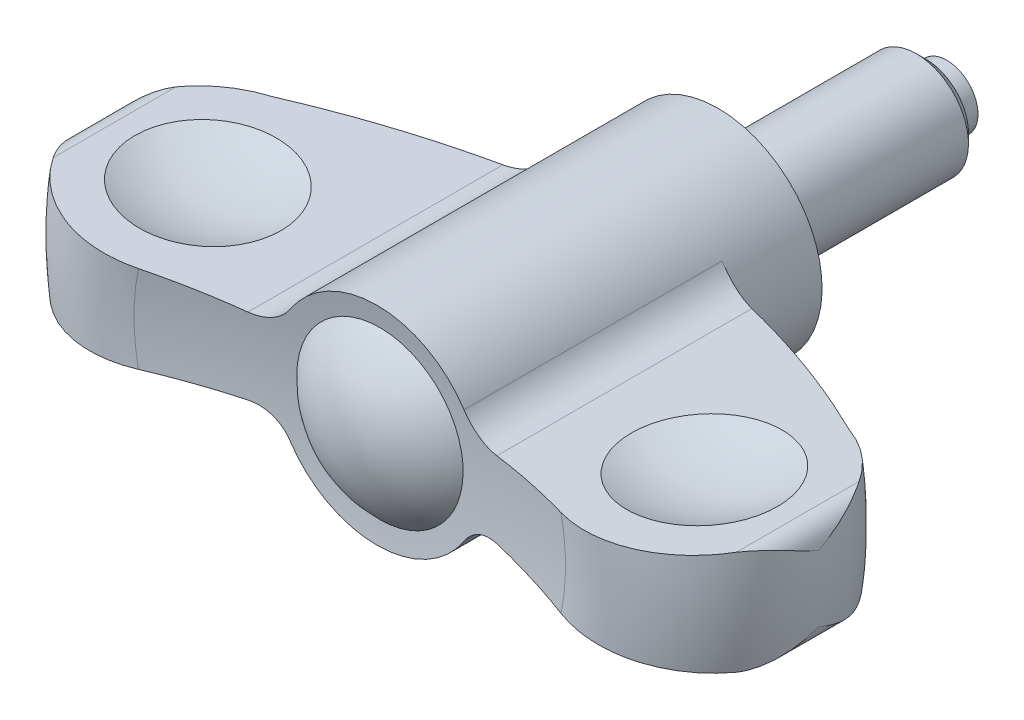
ISO-10303-21;
HEADER;
FILE_DESCRIPTION(('STEP AP214'),'2;1');
FILE_NAME('part.step','',(''),(''),'','','');
FILE_SCHEMA(('AUTOMOTIVE_DESIGN { 1 0 10303 214 1 1 1 1 }'));
ENDSEC;
DATA;
#1=APPLICATION_CONTEXT('core data for automotive mechanical design processes');
#2=APPLICATION_PROTOCOL_DEFINITION('international standard','automotive_design',2000,#1);
#3=PRODUCT_CONTEXT('',#1,'mechanical');
#4=PRODUCT('Part','Part','',(#3));
#5=PRODUCT_RELATED_PRODUCT_CATEGORY('part','',(#4));
#6=PRODUCT_DEFINITION_FORMATION('','',#4);
#7=PRODUCT_DEFINITION_CONTEXT('part definition',#1,'design');
#8=PRODUCT_DEFINITION('design','',#6,#7);
#9=PRODUCT_DEFINITION_SHAPE('','',#8);
#10=(LENGTH_UNIT() NAMED_UNIT(*) SI_UNIT(.MILLI.,.METRE.));
#11=(NAMED_UNIT(*) PLANE_ANGLE_UNIT() SI_UNIT($,.RADIAN.));
#12=(NAMED_UNIT(*) SI_UNIT($,.STERADIAN.) SOLID_ANGLE_UNIT());
#13=UNCERTAINTY_MEASURE_WITH_UNIT(LENGTH_MEASURE(1.E-05),#10,'distance_accuracy_value','');
#14=(GEOMETRIC_REPRESENTATION_CONTEXT(3) GLOBAL_UNCERTAINTY_ASSIGNED_CONTEXT((#13)) GLOBAL_UNIT_ASSIGNED_CONTEXT((#10,
#11,#12)) REPRESENTATION_CONTEXT('',''));
#15=CARTESIAN_POINT('',(0.,0.,0.));
#16=DIRECTION('',(0.,0.,1.));
#17=DIRECTION('',(1.,0.,0.));
#18=AXIS2_PLACEMENT_3D('',#15,#16,#17);
#19=CARTESIAN_POINT('',(0.,0.,94.3779064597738));
#20=DIRECTION('',(0.,0.,-1.));
#21=DIRECTION('',(0.,1.,0.));
#22=AXIS2_PLACEMENT_3D('',#19,#20,#21);
#23=DEGENERATE_TOROIDAL_SURFACE('',#22,13.5323057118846,89.5260416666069,.F.);
#24=CARTESIAN_POINT('',(11.974701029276,3.66644663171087,8.72739110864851));
#25=CARTESIAN_POINT('',(11.8626845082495,3.65928084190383,8.69417121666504));
#26=CARTESIAN_POINT('',(11.7501999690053,3.65683705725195,8.66148506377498));
#27=CARTESIAN_POINT('',(11.5250251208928,3.66146055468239,8.59744040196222));
#28=CARTESIAN_POINT('',(11.4123347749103,3.66852976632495,8.56608216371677));
#29=CARTESIAN_POINT('',(11.1873555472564,3.69226711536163,8.50492122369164));
#30=CARTESIAN_POINT('',(11.0750675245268,3.70894967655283,8.47512093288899));
#31=CARTESIAN_POINT('',(10.8518573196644,3.75192268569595,8.4174113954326));
#32=CARTESIAN_POINT('',(10.7409350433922,3.77821246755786,8.3895020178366));
#33=CARTESIAN_POINT('',(10.5209960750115,3.84041444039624,8.33580035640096));
#34=CARTESIAN_POINT('',(10.411984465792,3.87634906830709,8.31001319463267));
#35=CARTESIAN_POINT('',(10.1969726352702,3.95767948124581,8.2609301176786));
#36=CARTESIAN_POINT('',(10.0909722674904,4.0030748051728,8.2376340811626));
#37=CARTESIAN_POINT('',(9.88296652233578,4.10304797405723,8.19386124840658));
#38=CARTESIAN_POINT('',(9.78095589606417,4.15761321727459,8.17338065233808));
#39=CARTESIAN_POINT('',(9.58168184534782,4.27563508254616,8.13550071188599));
#40=CARTESIAN_POINT('',(9.48441603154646,4.3390871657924,8.11809980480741));
#41=CARTESIAN_POINT('',(9.2904965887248,4.47803359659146,8.08581609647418));
#42=CARTESIAN_POINT('',(9.1941384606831,4.55398290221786,8.07111155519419));
#43=CARTESIAN_POINT('',(9.00851292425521,4.71470710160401,8.04566935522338));
#44=CARTESIAN_POINT('',(8.91924567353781,4.79948219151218,8.03493178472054));
#45=CARTESIAN_POINT('',(8.74817455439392,4.9777034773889,8.01758669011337));
#46=CARTESIAN_POINT('',(8.66642211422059,5.07120170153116,8.01100604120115));
#47=CARTESIAN_POINT('',(8.51183266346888,5.26553635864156,8.00220235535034));
#48=CARTESIAN_POINT('',(8.43899852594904,5.36637513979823,7.99998071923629));
#49=CARTESIAN_POINT('',(8.37105193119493,5.47041952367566,8.00000000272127));
#50=B_SPLINE_CURVE_WITH_KNOTS('',3,(#24,#25,#26,#27,#28,#29,#30,#31,#32,#33,#34,#35,#36,#37,#38,
#39,#40,#41,#42,#43,#44,#45,#46,#47,#48,#49),.UNSPECIFIED.,.F.,.F.,(4,2,2,2,2,2,2,2,2,2,2,2,4),
(0.,0.351089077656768,0.702249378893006,1.0539379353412,1.40560211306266,1.75809157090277,
2.1105638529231,2.4625556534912,2.81436833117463,3.1844969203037,3.55463373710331,
3.92713969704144,4.29976534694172),.UNSPECIFIED.);
#51=CARTESIAN_POINT('',(11.974501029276,3.6664338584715,8.72733179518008));
#52=VERTEX_POINT('',#51);
#53=CARTESIAN_POINT('',(8.3711826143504,5.4702195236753,8.));
#54=VERTEX_POINT('',#53);
#55=EDGE_CURVE('E156',#52,#54,#50,.T.);
#56=ORIENTED_EDGE('',*,*,#55,.F.);
#57=CARTESIAN_POINT('',(27.7672650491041,4.67466039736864,15.151460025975));
#58=CARTESIAN_POINT('',(26.5054831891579,4.59410692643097,14.4896578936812));
#59=CARTESIAN_POINT('',(25.2277137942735,4.51253279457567,13.8582020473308));
#60=CARTESIAN_POINT('',(22.6463384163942,4.34773509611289,12.6591020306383));
#61=CARTESIAN_POINT('',(21.3428000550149,4.26451584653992,12.0913116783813));
#62=CARTESIAN_POINT('',(19.3681856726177,4.13845440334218,11.2874548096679));
#63=CARTESIAN_POINT('',(18.706726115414,4.0962261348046,11.0274609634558));
#64=CARTESIAN_POINT('',(17.3776947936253,4.01137938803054,10.5236280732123));
#65=CARTESIAN_POINT('',(16.710123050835,3.96876091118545,10.2797889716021));
#66=CARTESIAN_POINT('',(15.3676631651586,3.88305687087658,9.80796285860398));
#67=CARTESIAN_POINT('',(14.6927615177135,3.83997044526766,9.58001443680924));
#68=CARTESIAN_POINT('',(13.3375216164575,3.75345051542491,9.14094002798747));
#69=CARTESIAN_POINT('',(12.6571832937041,3.71001700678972,8.92981425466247));
#70=CARTESIAN_POINT('',(11.974301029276,3.66642109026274,8.72727248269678));
#71=B_SPLINE_CURVE_WITH_KNOTS('',3,(#57,#58,#59,#60,#61,#62,#63,#64,#65,#66,#67,#68,#69,#70),
.UNSPECIFIED.,.F.,.F.,(4,2,2,2,2,2,4),(0.,4.28107090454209,8.55210157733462,10.6878521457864,
12.823595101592,14.964355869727,17.1051438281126),.UNSPECIFIED.);
#72=CARTESIAN_POINT('',(27.7668837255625,4.67463605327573,15.151260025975));
#73=VERTEX_POINT('',#72);
#74=EDGE_CURVE('E201',#73,#52,#71,.T.);
#75=ORIENTED_EDGE('',*,*,#74,.F.);
#76=CARTESIAN_POINT('',(0.,0.,15.1512600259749));
#77=DIRECTION('',(0.,0.,-1.));
#78=DIRECTION('',(0.,1.,0.));
#79=AXIS2_PLACEMENT_3D('',#76,#77,#78);
#80=CIRCLE('',#79,28.1576287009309);
#81=CARTESIAN_POINT('',(27.7668837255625,-4.67463605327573,15.151260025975));
#82=VERTEX_POINT('',#81);
#83=EDGE_CURVE('E469',#73,#82,#80,.T.);
#84=ORIENTED_EDGE('',*,*,#83,.T.);
#85=CARTESIAN_POINT('',(11.974301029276,-3.66642109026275,8.72727248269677));
#86=CARTESIAN_POINT('',(12.4874096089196,-3.69917847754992,8.87944979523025));
#87=CARTESIAN_POINT('',(12.9990691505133,-3.73184335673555,9.03648048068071));
#88=CARTESIAN_POINT('',(14.0193683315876,-3.79698032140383,9.36009281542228));
#89=CARTESIAN_POINT('',(14.5280079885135,-3.82945240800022,9.52667440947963));
#90=CARTESIAN_POINT('',(16.0492634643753,-3.92657094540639,10.0405281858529));
#91=CARTESIAN_POINT('',(17.0571750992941,-3.99091707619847,10.4018972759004));
#92=CARTESIAN_POINT('',(19.0556157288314,-4.11849961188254,11.1599495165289));
#93=CARTESIAN_POINT('',(20.046193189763,-4.18173911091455,11.5565047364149));
#94=CARTESIAN_POINT('',(22.0122940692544,-4.30725704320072,12.385252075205));
#95=CARTESIAN_POINT('',(22.98781901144,-4.36953557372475,12.8174405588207));
#96=CARTESIAN_POINT('',(24.5975778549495,-4.47230425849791,13.5656862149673));
#97=CARTESIAN_POINT('',(25.2363554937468,-4.51308448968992,13.8719727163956));
#98=CARTESIAN_POINT('',(26.507156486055,-4.5942137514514,14.500135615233));
#99=CARTESIAN_POINT('',(27.1391710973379,-4.63456222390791,14.8220297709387));
#100=CARTESIAN_POINT('',(27.7672650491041,-4.67466039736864,15.151460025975));
#101=B_SPLINE_CURVE_WITH_KNOTS('',3,(#85,#86,#87,#88,#89,#90,#91,#92,#93,#94,#95,#96,#97,#98,
#99,#100),.UNSPECIFIED.,.F.,.F.,(4,2,2,2,2,2,2,4),(0.,1.60855024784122,3.21709119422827,
6.43430058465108,9.64025784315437,12.8458884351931,14.9744558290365,17.1055046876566),.UNSPECIFIED.);
#102=CARTESIAN_POINT('',(11.974501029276,-3.6664338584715,8.72733179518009));
#103=VERTEX_POINT('',#102);
#104=EDGE_CURVE('E262',#103,#82,#101,.T.);
#105=ORIENTED_EDGE('',*,*,#104,.F.);
#106=CARTESIAN_POINT('',(8.37105193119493,-5.47041952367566,8.00000000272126));
#107=CARTESIAN_POINT('',(8.42987619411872,-5.38036132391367,7.99998867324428));
#108=CARTESIAN_POINT('',(8.49235251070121,-5.29269899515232,8.0016498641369));
#109=CARTESIAN_POINT('',(8.62407576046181,-5.1227780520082,8.00825013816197));
#110=CARTESIAN_POINT('',(8.69332125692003,-5.04051829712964,8.01318852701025));
#111=CARTESIAN_POINT('',(8.83786319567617,-4.88220751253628,8.02625697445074));
#112=CARTESIAN_POINT('',(8.91314136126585,-4.80613903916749,8.03437766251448));
#113=CARTESIAN_POINT('',(9.06930832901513,-4.66046185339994,8.05367779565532));
#114=CARTESIAN_POINT('',(9.15019723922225,-4.59085326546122,8.06485729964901));
#115=CARTESIAN_POINT('',(9.40031010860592,-4.39245366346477,8.1027467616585));
#116=CARTESIAN_POINT('',(9.57716938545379,-4.27388252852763,8.13382523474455));
#117=CARTESIAN_POINT('',(9.94584435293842,-4.06687280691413,8.20600408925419));
#118=CARTESIAN_POINT('',(10.13767168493,-3.97845796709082,8.24711232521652));
#119=CARTESIAN_POINT('',(10.5372676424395,-3.83094076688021,8.33894932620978));
#120=CARTESIAN_POINT('',(10.745348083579,-3.77284952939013,8.38994035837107));
#121=CARTESIAN_POINT('',(11.1662642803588,-3.69098626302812,8.4986354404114));
#122=CARTESIAN_POINT('',(11.3790944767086,-3.66717605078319,8.55633194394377));
#123=CARTESIAN_POINT('',(11.6555725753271,-3.65830502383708,8.63450176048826));
#124=CARTESIAN_POINT('',(11.7195886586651,-3.65779498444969,8.65282658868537));
#125=CARTESIAN_POINT('',(11.8473452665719,-3.6598377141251,8.68983862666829));
#126=CARTESIAN_POINT('',(11.9110860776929,-3.66238510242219,8.70852514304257));
#127=CARTESIAN_POINT('',(11.974701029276,-3.66644663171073,8.72739110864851));
#128=B_SPLINE_CURVE_WITH_KNOTS('',3,(#106,#107,#108,#109,#110,#111,#112,#113,#114,#115,#116,
#117,#118,#119,#120,#121,#122,#123,#124,#125,#126,#127),.UNSPECIFIED.,.F.,.F.,(4,2,2,2,2,2,2,2,
2,2,4),(0.,0.322587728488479,0.645107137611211,0.966683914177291,1.28826688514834,
1.93060210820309,2.57344198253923,3.23653223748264,3.89888334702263,4.09860313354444,
4.29797194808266),.UNSPECIFIED.);
#129=CARTESIAN_POINT('',(8.3711826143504,-5.4702195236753,8.));
#130=VERTEX_POINT('',#129);
#131=EDGE_CURVE('E254',#130,#103,#128,.T.);
#132=ORIENTED_EDGE('',*,*,#131,.F.);
#133=CARTESIAN_POINT('',(0.,0.,8.));
#134=DIRECTION('',(0.,0.,-1.));
#135=DIRECTION('',(0.,1.,0.));
#136=AXIS2_PLACEMENT_3D('',#133,#134,#135);
#137=CIRCLE('',#136,10.);
#138=EDGE_CURVE('E462',#54,#130,#137,.T.);
#139=ORIENTED_EDGE('',*,*,#138,.F.);
#140=EDGE_LOOP('',(#56,#75,#84,#105,#132,#139));
#141=FACE_BOUND('',#140,.T.);
#142=ADVANCED_FACE('F14',(#141),#23,.F.);
#143=CARTESIAN_POINT('',(0.,0.,25.2));
#144=DIRECTION('',(0.,0.,-1.));
#145=DIRECTION('',(0.,1.,0.));
#146=AXIS2_PLACEMENT_3D('',#143,#144,#145);
#147=TOROIDAL_SURFACE('',#146,24.1999999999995,10.8000000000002);
#148=CARTESIAN_POINT('',(19.8094271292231,4.1666237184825,15.1510600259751));
#149=CARTESIAN_POINT('',(19.521941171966,4.14827031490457,15.2632988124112));
#150=CARTESIAN_POINT('',(19.2391962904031,4.13021958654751,15.3877140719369));
#151=CARTESIAN_POINT('',(18.6851350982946,4.09484774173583,15.6598852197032));
#152=CARTESIAN_POINT('',(18.4138184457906,4.07752660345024,15.807640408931));
#153=CARTESIAN_POINT('',(17.8845989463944,4.04374067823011,16.1254521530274));
#154=CARTESIAN_POINT('',(17.6266932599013,4.02727571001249,16.2955039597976));
#155=CARTESIAN_POINT('',(17.1260724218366,3.99531555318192,16.6567393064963));
#156=CARTESIAN_POINT('',(16.8833570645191,3.97982035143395,16.8479225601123));
#157=CARTESIAN_POINT('',(16.4147337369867,3.94990294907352,17.2502188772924));
#158=CARTESIAN_POINT('',(16.1888353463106,3.93548136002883,17.4613431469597));
#159=CARTESIAN_POINT('',(15.755661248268,3.90782707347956,17.9019729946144));
#160=CARTESIAN_POINT('',(15.5483853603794,3.89459436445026,18.1314783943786));
#161=CARTESIAN_POINT('',(15.1540682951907,3.86942075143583,18.6072254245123));
#162=CARTESIAN_POINT('',(14.9670217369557,3.85747950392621,18.8534625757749));
#163=CARTESIAN_POINT('',(14.6145533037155,3.83497755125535,19.3610162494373));
#164=CARTESIAN_POINT('',(14.4491311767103,3.82441683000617,19.6223325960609));
#165=CARTESIAN_POINT('',(14.1423037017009,3.80482864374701,20.1563589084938));
#166=CARTESIAN_POINT('',(14.0007403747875,3.79579109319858,20.4289777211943));
#167=CARTESIAN_POINT('',(13.7414172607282,3.77923563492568,20.9853603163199));
#168=CARTESIAN_POINT('',(13.6236574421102,3.771717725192,21.2691240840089));
#169=CARTESIAN_POINT('',(13.4129494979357,3.75826591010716,21.8457675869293));
#170=CARTESIAN_POINT('',(13.3200020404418,3.75233204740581,22.138647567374));
#171=CARTESIAN_POINT('',(13.1597528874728,3.74210157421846,22.7313695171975));
#172=CARTESIAN_POINT('',(13.09245072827,3.73780493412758,23.0312113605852));
#173=CARTESIAN_POINT('',(12.9852187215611,3.7309591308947,23.6294343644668));
#174=CARTESIAN_POINT('',(12.9447569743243,3.72837601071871,23.9277198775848));
#175=CARTESIAN_POINT('',(12.889397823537,3.72484182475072,24.5266624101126));
#176=CARTESIAN_POINT('',(12.8745000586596,3.72389073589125,24.8273193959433));
#177=CARTESIAN_POINT('',(12.8704051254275,3.72362931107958,25.4287668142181));
#178=CARTESIAN_POINT('',(12.8812044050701,3.72431874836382,25.7295572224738));
#179=CARTESIAN_POINT('',(12.9283972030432,3.72733158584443,26.329113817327));
#180=CARTESIAN_POINT('',(12.9647906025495,3.72965497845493,26.6278800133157));
#181=CARTESIAN_POINT('',(13.0621879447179,3.73587292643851,27.2172682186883));
#182=CARTESIAN_POINT('',(13.1228581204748,3.73974617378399,27.5079456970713));
#183=CARTESIAN_POINT('',(13.2682686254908,3.74902933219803,28.083185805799));
#184=CARTESIAN_POINT('',(13.3530086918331,3.75443922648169,28.3677485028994));
#185=CARTESIAN_POINT('',(13.5458552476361,3.76675075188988,28.9288272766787));
#186=CARTESIAN_POINT('',(13.6539633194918,3.77365248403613,29.2053428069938));
#187=CARTESIAN_POINT('',(13.892668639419,3.78889168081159,29.7484482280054));
#188=CARTESIAN_POINT('',(14.0232661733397,3.79722916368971,30.0150379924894));
#189=CARTESIAN_POINT('',(14.3074636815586,3.81537262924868,30.5393506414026));
#190=CARTESIAN_POINT('',(14.4612972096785,3.82519352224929,30.7969464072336));
#191=CARTESIAN_POINT('',(14.7897260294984,3.84616076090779,31.2984830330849));
#192=CARTESIAN_POINT('',(14.964321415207,3.85730711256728,31.542423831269));
#193=CARTESIAN_POINT('',(15.332994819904,3.88084360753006,32.0150649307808));
#194=CARTESIAN_POINT('',(15.5270739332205,3.8932338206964,32.243764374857));
#195=CARTESIAN_POINT('',(15.9333227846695,3.91916917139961,32.6844276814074));
#196=CARTESIAN_POINT('',(16.1454932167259,3.93271435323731,32.8963909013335));
#197=CARTESIAN_POINT('',(16.5910171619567,3.96115706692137,33.3064124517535));
#198=CARTESIAN_POINT('',(16.8247188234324,3.97607682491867,33.5040910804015));
#199=CARTESIAN_POINT('',(17.3077586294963,4.0069145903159,33.8792342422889));
#200=CARTESIAN_POINT('',(17.5570969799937,4.0228326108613,34.0566985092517));
#201=CARTESIAN_POINT('',(18.0696721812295,4.05555594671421,34.3902150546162));
#202=CARTESIAN_POINT('',(18.3329099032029,4.07236131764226,34.546265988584));
#203=CARTESIAN_POINT('',(18.8714293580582,4.10674096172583,34.8358677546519));
#204=CARTESIAN_POINT('',(19.1467108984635,4.12431522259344,34.9694189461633));
#205=CARTESIAN_POINT('',(19.710494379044,4.16030774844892,35.2144334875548));
#206=CARTESIAN_POINT('',(19.9991082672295,4.1787331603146,35.3256382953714));
#207=CARTESIAN_POINT('',(20.5846589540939,4.216115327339,35.5232991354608));
#208=CARTESIAN_POINT('',(20.8815958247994,4.23507208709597,35.609754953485));
#209=CARTESIAN_POINT('',(21.4816933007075,4.27338293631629,35.7572774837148));
#210=CARTESIAN_POINT('',(21.7848540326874,4.29273703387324,35.8183436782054));
#211=CARTESIAN_POINT('',(22.3952378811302,4.33170457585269,35.9146144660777));
#212=CARTESIAN_POINT('',(22.7024609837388,4.35131801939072,35.9498191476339));
#213=CARTESIAN_POINT('',(23.3185771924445,4.39065152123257,35.9940613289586));
#214=CARTESIAN_POINT('',(23.6274690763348,4.41037150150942,36.0031159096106));
#215=CARTESIAN_POINT('',(24.2449112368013,4.44978965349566,35.9949986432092));
#216=CARTESIAN_POINT('',(24.5534615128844,4.46948782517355,35.9778267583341));
#217=CARTESIAN_POINT('',(25.1679638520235,4.50871829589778,35.9173391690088));
#218=CARTESIAN_POINT('',(25.4739162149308,4.52825061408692,35.87402652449));
#219=CARTESIAN_POINT('',(26.0810457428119,4.56701039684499,35.7615284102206));
#220=CARTESIAN_POINT('',(26.3822229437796,4.58623786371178,35.692343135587));
#221=CARTESIAN_POINT('',(26.9757928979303,4.62413198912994,35.5290595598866));
#222=CARTESIAN_POINT('',(27.2682281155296,4.64280135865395,35.4351162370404));
#223=CARTESIAN_POINT('',(27.8441179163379,4.67956676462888,35.2227578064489));
#224=CARTESIAN_POINT('',(28.1275723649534,4.69766279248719,35.1043423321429));
#225=CARTESIAN_POINT('',(28.6835841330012,4.73315916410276,34.8437895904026));
#226=CARTESIAN_POINT('',(28.9561358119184,4.75055914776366,34.7016402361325));
#227=CARTESIAN_POINT('',(29.4881932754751,4.78452625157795,34.3946618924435));
#228=CARTESIAN_POINT('',(29.7476996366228,4.80109340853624,34.2298339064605));
#229=CARTESIAN_POINT('',(30.2504147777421,4.83318726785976,33.8796120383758));
#230=CARTESIAN_POINT('',(30.4937042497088,4.84871912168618,33.6943344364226));
#231=CARTESIAN_POINT('',(30.9637439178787,4.87872694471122,33.3038019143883));
#232=CARTESIAN_POINT('',(31.1904947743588,4.89320295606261,33.0985477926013));
#233=CARTESIAN_POINT('',(31.625376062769,4.92096623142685,32.6699535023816));
#234=CARTESIAN_POINT('',(31.8335423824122,4.93425578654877,32.4466498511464));
#235=CARTESIAN_POINT('',(32.2301600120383,4.95957626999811,31.9832771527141));
#236=CARTESIAN_POINT('',(32.4186239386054,4.97160800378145,31.743219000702));
#237=CARTESIAN_POINT('',(32.6424762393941,4.98589896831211,31.4317807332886));
#238=CARTESIAN_POINT('',(32.6877085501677,4.98878664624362,31.3673743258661));
#239=CARTESIAN_POINT('',(32.776715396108,4.99446893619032,31.2376428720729));
#240=CARTESIAN_POINT('',(32.820491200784,4.99726362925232,31.1723187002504));
#241=CARTESIAN_POINT('',(32.86355345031,5.00001276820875,31.1065166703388));
#242=B_SPLINE_CURVE_WITH_KNOTS('',3,(#148,#149,#150,#151,#152,#153,#154,#155,#156,#157,#158,
#159,#160,#161,#162,#163,#164,#165,#166,#167,#168,#169,#170,#171,#172,#173,#174,#175,#176,#177,
#178,#179,#180,#181,#182,#183,#184,#185,#186,#187,#188,#189,#190,#191,#192,#193,#194,#195,#196,
#197,#198,#199,#200,#201,#202,#203,#204,#205,#206,#207,#208,#209,#210,#211,#212,#213,#214,#215,
#216,#217,#218,#219,#220,#221,#222,#223,#224,#225,#226,#227,#228,#229,#230,#231,#232,#233,#234,
#235,#236,#237,#238,#239,#240,#241),.UNSPECIFIED.,.F.,.F.,(4,2,2,2,2,2,2,2,2,2,2,2,2,2,2,2,2,2,
2,2,2,2,2,2,2,2,2,2,2,2,2,2,2,2,2,2,2,2,2,2,2,2,2,2,2,2,4),(0.,0.927211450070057,
1.85439513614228,2.78138169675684,3.70835569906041,4.63585376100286,5.56334283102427,
6.49058458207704,7.41781552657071,8.3386426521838,9.2594685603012,10.1803192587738,
11.1011533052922,12.0031457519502,12.9051254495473,13.8069804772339,14.7088313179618,
15.5986872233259,16.4885334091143,17.3784398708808,18.2683576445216,19.1679024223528,
20.0674512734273,20.9670506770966,21.8666846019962,22.7849824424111,23.7032923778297,
24.6216599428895,25.5400128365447,26.4684461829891,27.3968875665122,28.325347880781,
29.25380502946,30.1816555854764,31.1095074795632,32.0372507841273,32.9649870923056,
33.8870485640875,34.8091238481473,35.7316701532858,36.6541756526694,37.5716823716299,
38.4891524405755,39.4048106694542,40.3198789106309,40.5561351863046,40.7921798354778),.UNSPECIFIED.);
#243=CARTESIAN_POINT('',(20.3283313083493,4.19975110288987,35.436701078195));
#244=VERTEX_POINT('',#243);
#245=CARTESIAN_POINT('',(32.86335345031,5.,31.1068222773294));
#246=VERTEX_POINT('',#245);
#247=EDGE_CURVE('E270',#244,#246,#242,.T.);
#248=ORIENTED_EDGE('',*,*,#247,.F.);
#249=CARTESIAN_POINT('',(0.,0.,35.436701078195));
#250=DIRECTION('',(0.,0.,-1.));
#251=DIRECTION('',(0.,1.,0.));
#252=AXIS2_PLACEMENT_3D('',#249,#250,#251);
#253=CIRCLE('',#252,20.757624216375);
#254=CARTESIAN_POINT('',(20.3283313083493,-4.19975110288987,35.436701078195));
#255=VERTEX_POINT('',#254);
#256=EDGE_CURVE('E207',#244,#255,#253,.T.);
#257=ORIENTED_EDGE('',*,*,#256,.T.);
#258=CARTESIAN_POINT('',(32.86355345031,-5.00001276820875,31.1065166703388));
#259=CARTESIAN_POINT('',(32.6970155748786,-4.98938081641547,31.3610626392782));
#260=CARTESIAN_POINT('',(32.5196781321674,-4.97805940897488,31.6085043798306));
#261=CARTESIAN_POINT('',(32.1448146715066,-4.95412773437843,32.0874989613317));
#262=CARTESIAN_POINT('',(31.9472900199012,-4.94151755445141,32.319052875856));
#263=CARTESIAN_POINT('',(31.533625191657,-4.91510876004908,32.7644266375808));
#264=CARTESIAN_POINT('',(31.3175018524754,-4.90131122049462,32.978262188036));
#265=CARTESIAN_POINT('',(30.8680530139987,-4.87261793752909,33.386932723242));
#266=CARTESIAN_POINT('',(30.6347276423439,-4.85772220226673,33.5817678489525));
#267=CARTESIAN_POINT('',(30.1524568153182,-4.82693352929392,33.9511443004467));
#268=CARTESIAN_POINT('',(29.9035056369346,-4.81104022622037,34.1256781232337));
#269=CARTESIAN_POINT('',(29.3918426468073,-4.77837512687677,34.4531585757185));
#270=CARTESIAN_POINT('',(29.1291307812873,-4.76160332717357,34.6061051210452));
#271=CARTESIAN_POINT('',(28.5918605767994,-4.72730343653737,34.8893375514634));
#272=CARTESIAN_POINT('',(28.317303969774,-4.70977545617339,35.0196267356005));
#273=CARTESIAN_POINT('',(27.7582600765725,-4.67408551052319,35.256686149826));
#274=CARTESIAN_POINT('',(27.4737728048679,-4.65592354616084,35.3634564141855));
#275=CARTESIAN_POINT('',(26.8959018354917,-4.61903166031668,35.5530849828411));
#276=CARTESIAN_POINT('',(26.6024912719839,-4.60030002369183,35.6358610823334));
#277=CARTESIAN_POINT('',(26.0097777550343,-4.56246057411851,35.7764716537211));
#278=CARTESIAN_POINT('',(25.7104747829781,-4.54335275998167,35.8343060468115));
#279=CARTESIAN_POINT('',(25.1080405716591,-4.50489273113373,35.9246751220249));
#280=CARTESIAN_POINT('',(24.804908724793,-4.48554047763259,35.957205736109));
#281=CARTESIAN_POINT('',(24.1969928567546,-4.44673049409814,35.9967664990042));
#282=CARTESIAN_POINT('',(23.8922088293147,-4.4272727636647,36.0037965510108));
#283=CARTESIAN_POINT('',(23.2812746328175,-4.38827008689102,35.9923141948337));
#284=CARTESIAN_POINT('',(22.9751273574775,-4.36872532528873,35.9736469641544));
#285=CARTESIAN_POINT('',(22.3654717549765,-4.32980427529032,35.910667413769));
#286=CARTESIAN_POINT('',(22.0619634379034,-4.31042798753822,35.8663549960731));
#287=CARTESIAN_POINT('',(21.4597220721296,-4.27198027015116,35.752435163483));
#288=CARTESIAN_POINT('',(21.1609888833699,-4.25290883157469,35.6828284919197));
#289=CARTESIAN_POINT('',(20.5703741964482,-4.21520337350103,35.5188386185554));
#290=CARTESIAN_POINT('',(20.2784927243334,-4.19656935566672,35.4244553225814));
#291=CARTESIAN_POINT('',(19.7018002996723,-4.15975270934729,35.2109220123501));
#292=CARTESIAN_POINT('',(19.4170455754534,-4.14157367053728,35.0916194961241));
#293=CARTESIAN_POINT('',(18.8585419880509,-4.10591821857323,34.8294691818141));
#294=CARTESIAN_POINT('',(18.5847931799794,-4.08844180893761,34.6866212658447));
#295=CARTESIAN_POINT('',(18.0502819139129,-4.05431805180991,34.3784131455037));
#296=CARTESIAN_POINT('',(17.7895173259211,-4.0376705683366,34.2130566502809));
#297=CARTESIAN_POINT('',(17.2826654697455,-4.00531261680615,33.8608847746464));
#298=CARTESIAN_POINT('',(17.0365849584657,-3.98960258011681,33.6740596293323));
#299=CARTESIAN_POINT('',(16.5603945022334,-3.9592020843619,33.2798000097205));
#300=CARTESIAN_POINT('',(16.3303268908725,-3.94451432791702,33.0723141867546));
#301=CARTESIAN_POINT('',(15.88864842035,-3.9163171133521,32.6386690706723));
#302=CARTESIAN_POINT('',(15.6770290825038,-3.90280711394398,32.4125184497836));
#303=CARTESIAN_POINT('',(15.273673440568,-3.87705646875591,31.942972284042));
#304=CARTESIAN_POINT('',(15.0819415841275,-3.86481610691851,31.6995729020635));
#305=CARTESIAN_POINT('',(14.7199002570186,-3.84170301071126,31.1972686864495));
#306=CARTESIAN_POINT('',(14.5495906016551,-3.83083026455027,30.938363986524));
#307=CARTESIAN_POINT('',(14.2330366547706,-3.8106211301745,30.4090093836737));
#308=CARTESIAN_POINT('',(14.0866097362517,-3.80127308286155,30.1386691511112));
#309=CARTESIAN_POINT('',(13.8173755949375,-3.78408489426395,29.5864219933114));
#310=CARTESIAN_POINT('',(13.6945682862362,-3.77624474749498,29.3045151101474));
#311=CARTESIAN_POINT('',(13.4736346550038,-3.76214011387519,28.7311892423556));
#312=CARTESIAN_POINT('',(13.3755052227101,-3.75587542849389,28.4397714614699));
#313=CARTESIAN_POINT('',(13.2047780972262,-3.74497603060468,27.8495203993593));
#314=CARTESIAN_POINT('',(13.1321799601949,-3.74034128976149,27.5506872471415));
#315=CARTESIAN_POINT('',(13.0143769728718,-3.73282062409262,26.9538991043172));
#316=CARTESIAN_POINT('',(12.9686502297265,-3.72990138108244,26.6560474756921));
#317=CARTESIAN_POINT('',(12.9027598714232,-3.72569487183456,26.0575192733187));
#318=CARTESIAN_POINT('',(12.8825958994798,-3.72440758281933,25.7568427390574));
#319=CARTESIAN_POINT('',(12.8680159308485,-3.7234767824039,25.1548864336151));
#320=CARTESIAN_POINT('',(12.8735980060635,-3.72383314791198,24.8536067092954));
#321=CARTESIAN_POINT('',(12.9104544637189,-3.72618610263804,24.2526307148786));
#322=CARTESIAN_POINT('',(12.9417287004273,-3.72818268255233,23.9529344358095));
#323=CARTESIAN_POINT('',(13.0290553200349,-3.7337577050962,23.3615637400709));
#324=CARTESIAN_POINT('',(13.0847478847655,-3.73731317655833,23.0698358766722));
#325=CARTESIAN_POINT('',(13.2203342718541,-3.74596915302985,22.4920881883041));
#326=CARTESIAN_POINT('',(13.3002278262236,-3.75106964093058,22.2060683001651));
#327=CARTESIAN_POINT('',(13.4835377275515,-3.76277233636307,21.641717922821));
#328=CARTESIAN_POINT('',(13.5869530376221,-3.76937447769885,21.3633870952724));
#329=CARTESIAN_POINT('',(13.8164657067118,-3.78402680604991,20.8162811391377));
#330=CARTESIAN_POINT('',(13.9425632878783,-3.79207700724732,20.5475061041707));
#331=CARTESIAN_POINT('',(14.2177511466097,-3.80964528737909,20.018798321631));
#332=CARTESIAN_POINT('',(14.3670482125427,-3.81917656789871,19.7589736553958));
#333=CARTESIAN_POINT('',(14.6866052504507,-3.83957742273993,19.2525984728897));
#334=CARTESIAN_POINT('',(14.8568660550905,-3.85044705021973,19.0060484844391));
#335=CARTESIAN_POINT('',(15.2171824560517,-3.8734500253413,18.527716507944));
#336=CARTESIAN_POINT('',(15.4072489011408,-3.88558406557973,18.2959427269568));
#337=CARTESIAN_POINT('',(15.8057255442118,-3.91102323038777,17.8488248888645));
#338=CARTESIAN_POINT('',(16.0141353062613,-3.924328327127,17.6334804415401));
#339=CARTESIAN_POINT('',(16.4525588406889,-3.95231774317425,17.2161199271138));
#340=CARTESIAN_POINT('',(16.682943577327,-3.96702574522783,17.0144950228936));
#341=CARTESIAN_POINT('',(17.1596933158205,-3.99746194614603,16.6312115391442));
#342=CARTESIAN_POINT('',(17.4060580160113,-4.01319012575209,16.449552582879));
#343=CARTESIAN_POINT('',(17.9125776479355,-4.04552686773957,16.1077341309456));
#344=CARTESIAN_POINT('',(18.1727078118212,-4.06213384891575,15.9475377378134));
#345=CARTESIAN_POINT('',(18.7052437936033,-4.09613150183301,15.6494302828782));
#346=CARTESIAN_POINT('',(18.977642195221,-4.11352170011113,15.511505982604));
#347=CARTESIAN_POINT('',(19.3465341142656,-4.13707214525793,15.3436217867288));
#348=CARTESIAN_POINT('',(19.4384317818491,-4.14293898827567,15.3033100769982));
#349=CARTESIAN_POINT('',(19.6231938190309,-4.15473438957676,15.2252627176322));
#350=CARTESIAN_POINT('',(19.7160570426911,-4.16066287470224,15.1875243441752));
#351=CARTESIAN_POINT('',(19.8094271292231,-4.1666237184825,15.1510600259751));
#352=B_SPLINE_CURVE_WITH_KNOTS('',3,(#258,#259,#260,#261,#262,#263,#264,#265,#266,#267,#268,
#269,#270,#271,#272,#273,#274,#275,#276,#277,#278,#279,#280,#281,#282,#283,#284,#285,#286,#287,
#288,#289,#290,#291,#292,#293,#294,#295,#296,#297,#298,#299,#300,#301,#302,#303,#304,#305,#306,
#307,#308,#309,#310,#311,#312,#313,#314,#315,#316,#317,#318,#319,#320,#321,#322,#323,#324,#325,
#326,#327,#328,#329,#330,#331,#332,#333,#334,#335,#336,#337,#338,#339,#340,#341,#342,#343,#344,
#345,#346,#347,#348,#349,#350,#351),.UNSPECIFIED.,.F.,.F.,(4,2,2,2,2,2,2,2,2,2,2,2,2,2,2,2,2,2,
2,2,2,2,2,2,2,2,2,2,2,2,2,2,2,2,2,2,2,2,2,2,2,2,2,2,2,2,4),(0.,0.912828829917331,
1.8255959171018,2.73754519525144,3.64948770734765,4.5617661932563,5.47404824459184,
6.38619735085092,7.29834512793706,8.21358198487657,9.12882173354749,10.04420859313,
10.9595989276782,11.8805285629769,12.8014617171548,13.7223678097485,14.6432774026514,
15.569997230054,16.4967216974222,17.423293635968,18.3502887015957,19.2796480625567,
20.2085780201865,21.1377152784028,22.0668445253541,22.9884970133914,23.9101461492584,
24.8316790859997,25.7531960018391,26.6561671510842,27.559125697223,28.4620166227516,
29.3649024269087,30.2549087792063,31.1449052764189,32.0348625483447,32.9248285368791,
33.8232378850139,34.7216829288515,35.6206227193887,36.5195411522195,37.4379872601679,
38.3564160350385,39.2732450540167,40.1895270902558,40.4910655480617,40.792279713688),.UNSPECIFIED.);
#353=CARTESIAN_POINT('',(32.86335345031,-5.,31.1068222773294));
#354=VERTEX_POINT('',#353);
#355=EDGE_CURVE('E292',#354,#255,#352,.T.);
#356=ORIENTED_EDGE('',*,*,#355,.F.);
#357=CARTESIAN_POINT('',(34.8550718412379,-3.18181818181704,25.2));
#358=CARTESIAN_POINT('',(34.854816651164,-3.18461365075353,25.2063339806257));
#359=CARTESIAN_POINT('',(34.8545555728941,-3.18740861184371,25.2126680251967));
#360=CARTESIAN_POINT('',(34.8413131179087,-3.32602286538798,25.5268629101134));
#361=CARTESIAN_POINT('',(34.814430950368,-3.46059898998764,25.8348634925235));
#362=CARTESIAN_POINT('',(34.7331429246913,-3.72302915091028,26.4501493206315));
#363=CARTESIAN_POINT('',(34.678728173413,-3.8508810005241,26.7574343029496));
#364=CARTESIAN_POINT('',(34.5425422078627,-4.09540419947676,27.3704461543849));
#365=CARTESIAN_POINT('',(34.4607711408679,-4.21207560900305,27.6761730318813));
#366=CARTESIAN_POINT('',(34.2700177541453,-4.42903994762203,28.2849033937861));
#367=CARTESIAN_POINT('',(34.1610499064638,-4.52934154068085,28.5879082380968));
#368=CARTESIAN_POINT('',(33.9615538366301,-4.67422314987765,29.0782860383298));
#369=CARTESIAN_POINT('',(33.8791281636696,-4.7256866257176,29.2669483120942));
#370=CARTESIAN_POINT('',(33.7038328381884,-4.81752106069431,29.641969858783));
#371=CARTESIAN_POINT('',(33.6109712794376,-4.85790053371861,29.828330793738));
#372=CARTESIAN_POINT('',(33.4146279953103,-4.92533601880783,30.1990092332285));
#373=CARTESIAN_POINT('',(33.3111018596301,-4.9523333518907,30.3833143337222));
#374=CARTESIAN_POINT('',(33.148515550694,-4.98033159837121,30.6569567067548));
#375=CARTESIAN_POINT('',(33.0930344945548,-4.98758253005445,30.7478066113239));
#376=CARTESIAN_POINT('',(32.9797779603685,-4.99741570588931,30.9283687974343));
#377=CARTESIAN_POINT('',(32.9220015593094,-4.99999605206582,31.0180806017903));
#378=CARTESIAN_POINT('',(32.8631534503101,-4.99999999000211,31.1071249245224));
#379=B_SPLINE_CURVE_WITH_KNOTS('',3,(#357,#358,#359,#360,#361,#362,#363,#364,#365,#366,#367,
#368,#369,#370,#371,#372,#373,#374,#375,#376,#377,#378),.UNSPECIFIED.,.F.,.F.,(4,2,2,2,2,2,2,2,
2,2,4),(0.,0.0207846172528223,1.03099359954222,2.04152909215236,3.05205914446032,
4.06205261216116,4.69822653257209,5.33391041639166,5.97235756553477,6.29233329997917,
6.61243903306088),.UNSPECIFIED.);
#380=CARTESIAN_POINT('',(34.855071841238,-3.1818181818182,25.2));
#381=VERTEX_POINT('',#380);
#382=EDGE_CURVE('E495',#381,#354,#379,.T.);
#383=ORIENTED_EDGE('',*,*,#382,.F.);
#384=CARTESIAN_POINT('',(32.86315345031,-4.99999999,19.2928750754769));
#385=CARTESIAN_POINT('',(32.9204245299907,-4.99999689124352,19.3795334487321));
#386=CARTESIAN_POINT('',(32.9766813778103,-4.99755259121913,19.4668248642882));
#387=CARTESIAN_POINT('',(33.0870248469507,-4.98822605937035,19.6424924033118));
#388=CARTESIAN_POINT('',(33.1411122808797,-4.98134550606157,19.7308681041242));
#389=CARTESIAN_POINT('',(33.2997394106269,-4.95475161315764,19.9970588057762));
#390=CARTESIAN_POINT('',(33.4008962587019,-4.92908209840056,20.1763189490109));
#391=CARTESIAN_POINT('',(33.5930343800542,-4.8648794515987,20.5367487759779));
#392=CARTESIAN_POINT('',(33.6840616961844,-4.8264079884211,20.7179053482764));
#393=CARTESIAN_POINT('',(33.856259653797,-4.73881327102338,21.082433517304));
#394=CARTESIAN_POINT('',(33.937423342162,-4.68968257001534,21.2658065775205));
#395=CARTESIAN_POINT('',(34.1250936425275,-4.55775807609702,21.7199139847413));
#396=CARTESIAN_POINT('',(34.2258211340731,-4.46993758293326,21.9915983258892));
#397=CARTESIAN_POINT('',(34.4053621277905,-4.28033823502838,22.5372055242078));
#398=CARTESIAN_POINT('',(34.4841687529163,-4.17855501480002,22.8111290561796));
#399=CARTESIAN_POINT('',(34.6876169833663,-3.85796642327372,23.6355240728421));
#400=CARTESIAN_POINT('',(34.7793381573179,-3.62388247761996,24.1887442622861));
#401=CARTESIAN_POINT('',(34.8387994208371,-3.31913740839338,24.8880644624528));
#402=CARTESIAN_POINT('',(34.8481151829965,-3.25482439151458,25.0345212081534));
#403=CARTESIAN_POINT('',(34.8545555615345,-3.18740866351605,25.187331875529));
#404=CARTESIAN_POINT('',(34.8548166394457,-3.18461370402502,25.1936659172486));
#405=CARTESIAN_POINT('',(34.8550718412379,-3.18181818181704,25.2));
#406=B_SPLINE_CURVE_WITH_KNOTS('',3,(#384,#385,#386,#387,#388,#389,#390,#391,#392,#393,#394,
#395,#396,#397,#398,#399,#400,#401,#402,#403,#404,#405),.UNSPECIFIED.,.F.,.F.,(4,2,2,2,2,2,2,2,
2,2,4),(0.,0.31153330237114,0.622948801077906,1.24441287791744,1.86292559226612,
2.48187181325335,3.38880029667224,4.29601298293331,6.11002256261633,6.59067605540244,
6.61146067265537),.UNSPECIFIED.);
#407=CARTESIAN_POINT('',(32.86335345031,-5.,19.293177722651));
#408=VERTEX_POINT('',#407);
#409=EDGE_CURVE('E493',#408,#381,#406,.T.);
#410=ORIENTED_EDGE('',*,*,#409,.F.);
#411=CARTESIAN_POINT('',(27.7663742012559,-4.67460352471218,15.1510600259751));
#412=CARTESIAN_POINT('',(28.0530604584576,-4.69290587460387,15.2635441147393));
#413=CARTESIAN_POINT('',(28.3349478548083,-4.71090186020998,15.3883149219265));
#414=CARTESIAN_POINT('',(28.8871409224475,-4.74615444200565,15.6614255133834));
#415=CARTESIAN_POINT('',(29.1574456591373,-4.76341097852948,15.8097671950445));
#416=CARTESIAN_POINT('',(29.6777718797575,-4.79662914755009,16.1249558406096));
#417=CARTESIAN_POINT('',(29.9281336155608,-4.81261250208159,16.2912392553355));
#418=CARTESIAN_POINT('',(30.4141549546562,-4.84364061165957,16.6440736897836));
#419=CARTESIAN_POINT('',(30.6498172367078,-4.85868553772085,16.8306209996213));
#420=CARTESIAN_POINT('',(31.0661065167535,-4.88526187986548,17.189358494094));
#421=CARTESIAN_POINT('',(31.2492778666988,-4.8969557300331,17.3585962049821));
#422=CARTESIAN_POINT('',(31.6035001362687,-4.91956964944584,17.7093617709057));
#423=CARTESIAN_POINT('',(31.7745514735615,-4.93048974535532,17.8908892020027));
#424=CARTESIAN_POINT('',(32.1072399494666,-4.95172892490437,18.2694063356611));
#425=CARTESIAN_POINT('',(32.2685954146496,-4.96203002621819,18.4666446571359));
#426=CARTESIAN_POINT('',(32.5770083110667,-4.98171942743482,18.8720906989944));
#427=CARTESIAN_POINT('',(32.7240635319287,-4.99110758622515,19.0803001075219));
#428=CARTESIAN_POINT('',(32.86355345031,-5.00001276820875,19.293483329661));
#429=B_SPLINE_CURVE_WITH_KNOTS('',3,(#411,#412,#413,#414,#415,#416,#417,#418,#419,#420,#421,
#422,#423,#424,#425,#426,#427,#428),.UNSPECIFIED.,.F.,.F.,(4,2,2,2,2,2,2,2,4),(0.,
0.925249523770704,1.85057356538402,2.75247219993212,3.65420599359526,4.40260888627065,
5.15098597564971,5.91546208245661,6.68005616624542),.UNSPECIFIED.);
#430=EDGE_CURVE('E271',#82,#408,#429,.T.);
#431=ORIENTED_EDGE('',*,*,#430,.F.);
#432=ORIENTED_EDGE('',*,*,#83,.F.);
#433=CARTESIAN_POINT('',(32.86355345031,5.00001276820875,19.293483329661));
#434=CARTESIAN_POINT('',(32.6949692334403,4.98925017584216,19.035805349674));
#435=CARTESIAN_POINT('',(32.5153124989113,4.97778070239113,18.7854052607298));
#436=CARTESIAN_POINT('',(32.135308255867,4.95352083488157,18.3008838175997));
#437=CARTESIAN_POINT('',(31.9349600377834,4.94073039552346,18.0667630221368));
#438=CARTESIAN_POINT('',(31.5203431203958,4.91426081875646,17.6222280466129));
#439=CARTESIAN_POINT('',(31.3065539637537,4.90061229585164,17.4113643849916));
#440=CARTESIAN_POINT('',(30.8622376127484,4.87224667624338,17.0082143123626));
#441=CARTESIAN_POINT('',(30.6317132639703,4.85752976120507,16.8159247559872));
#442=CARTESIAN_POINT('',(30.1954858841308,4.82968054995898,16.4818110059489));
#443=CARTESIAN_POINT('',(29.9921035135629,4.81669640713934,16.3369316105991));
#444=CARTESIAN_POINT('',(29.5758344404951,4.79012135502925,16.0615997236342));
#445=CARTESIAN_POINT('',(29.3629480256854,4.77653046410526,15.9311467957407));
#446=CARTESIAN_POINT('',(28.9240172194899,4.74850866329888,15.6826331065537));
#447=CARTESIAN_POINT('',(28.6977881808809,4.73406596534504,15.5648997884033));
#448=CARTESIAN_POINT('',(28.2375924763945,4.70468659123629,15.3456631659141));
#449=CARTESIAN_POINT('',(28.0036247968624,4.68974985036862,15.2441619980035));
#450=CARTESIAN_POINT('',(27.7663742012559,4.67460352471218,15.1510600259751));
#451=B_SPLINE_CURVE_WITH_KNOTS('',3,(#433,#434,#435,#436,#437,#438,#439,#440,#441,#442,#443,
#444,#445,#446,#447,#448,#449,#450),.UNSPECIFIED.,.F.,.F.,(4,2,2,2,2,2,2,2,4),(0.,
0.924058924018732,1.84814954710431,2.74889473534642,3.64948712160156,4.3990485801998,
5.1485873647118,5.91427077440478,6.68005487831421),.UNSPECIFIED.);
#452=CARTESIAN_POINT('',(32.86335345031,5.,19.2931777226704));
#453=VERTEX_POINT('',#452);
#454=EDGE_CURVE('E490',#453,#73,#451,.T.);
#455=ORIENTED_EDGE('',*,*,#454,.F.);
#456=CARTESIAN_POINT('',(34.8550718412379,3.18181818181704,25.2));
#457=CARTESIAN_POINT('',(34.854816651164,3.18461365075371,25.1936660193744));
#458=CARTESIAN_POINT('',(34.8545555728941,3.18740861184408,25.1873319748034));
#459=CARTESIAN_POINT('',(34.8413131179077,3.32602286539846,24.8731370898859));
#460=CARTESIAN_POINT('',(34.814430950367,3.4605989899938,24.5651365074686));
#461=CARTESIAN_POINT('',(34.7331429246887,3.72302915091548,23.9498506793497));
#462=CARTESIAN_POINT('',(34.678728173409,3.85088100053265,23.6425656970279));
#463=CARTESIAN_POINT('',(34.5425422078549,4.09540419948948,23.0295538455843));
#464=CARTESIAN_POINT('',(34.460771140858,4.21207560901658,22.7238269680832));
#465=CARTESIAN_POINT('',(34.2700177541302,4.42903994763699,22.1150966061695));
#466=CARTESIAN_POINT('',(34.1610499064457,4.52934154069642,21.8120917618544));
#467=CARTESIAN_POINT('',(33.9615538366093,4.67422314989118,21.3217139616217));
#468=CARTESIAN_POINT('',(33.8791281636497,4.72568662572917,21.1330516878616));
#469=CARTESIAN_POINT('',(33.7038328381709,4.8175210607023,20.7580301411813));
#470=CARTESIAN_POINT('',(33.6109712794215,4.85790053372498,20.5716692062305));
#471=CARTESIAN_POINT('',(33.4146279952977,4.92533601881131,20.2009907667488));
#472=CARTESIAN_POINT('',(33.3111018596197,4.95233335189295,20.0166856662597));
#473=CARTESIAN_POINT('',(33.1485155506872,4.98033159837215,19.743043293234));
#474=CARTESIAN_POINT('',(33.0930344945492,4.98758253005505,19.6521933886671));
#475=CARTESIAN_POINT('',(32.9797779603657,4.99741570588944,19.4716312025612));
#476=CARTESIAN_POINT('',(32.9220015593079,4.99999605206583,19.3819193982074));
#477=CARTESIAN_POINT('',(32.8631534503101,4.99999999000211,19.2928750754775));
#478=B_SPLINE_CURVE_WITH_KNOTS('',3,(#456,#457,#458,#459,#460,#461,#462,#463,#464,#465,#466,
#467,#468,#469,#470,#471,#472,#473,#474,#475,#476,#477),.UNSPECIFIED.,.F.,.F.,(4,2,2,2,2,2,2,2,
2,2,4),(0.,0.0207846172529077,1.0309935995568,2.04152909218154,3.05205914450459,
4.06205261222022,4.6982265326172,5.33391041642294,5.97235756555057,6.2923332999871,
6.61243903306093),.UNSPECIFIED.);
#479=CARTESIAN_POINT('',(34.855071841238,3.18181818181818,25.2));
#480=VERTEX_POINT('',#479);
#481=EDGE_CURVE('E498',#480,#453,#478,.T.);
#482=ORIENTED_EDGE('',*,*,#481,.F.);
#483=CARTESIAN_POINT('',(32.86315345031,4.99999999,31.1071249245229));
#484=CARTESIAN_POINT('',(32.9204245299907,4.99999689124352,31.0204665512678));
#485=CARTESIAN_POINT('',(32.9766813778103,4.99755259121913,30.9331751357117));
#486=CARTESIAN_POINT('',(33.0870248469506,4.98822605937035,30.7575075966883));
#487=CARTESIAN_POINT('',(33.1411122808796,4.98134550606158,30.6691318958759));
#488=CARTESIAN_POINT('',(33.2997394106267,4.95475161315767,30.402941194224));
#489=CARTESIAN_POINT('',(33.4008962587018,4.9290820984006,30.2236810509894));
#490=CARTESIAN_POINT('',(33.5930343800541,4.86487945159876,29.8632512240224));
#491=CARTESIAN_POINT('',(33.6840616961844,4.82640798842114,29.6820946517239));
#492=CARTESIAN_POINT('',(33.856259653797,4.7388132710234,29.317566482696));
#493=CARTESIAN_POINT('',(33.9374233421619,4.68968257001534,29.1341934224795));
#494=CARTESIAN_POINT('',(34.1250936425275,4.55775807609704,28.6800860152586));
#495=CARTESIAN_POINT('',(34.2258211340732,4.46993758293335,28.4084016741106));
#496=CARTESIAN_POINT('',(34.4053621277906,4.28033823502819,27.8627944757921));
#497=CARTESIAN_POINT('',(34.4841687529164,4.17855501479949,27.5888709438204));
#498=CARTESIAN_POINT('',(34.6876169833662,3.85796642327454,26.7644759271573));
#499=CARTESIAN_POINT('',(34.7793381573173,3.62388247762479,26.2112557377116));
#500=CARTESIAN_POINT('',(34.8387994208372,3.3191374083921,25.5119355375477));
#501=CARTESIAN_POINT('',(34.8481151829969,3.25482439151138,25.3654787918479));
#502=CARTESIAN_POINT('',(34.8545555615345,3.18740866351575,25.2126681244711));
#503=CARTESIAN_POINT('',(34.8548166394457,3.18461370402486,25.2063340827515));
#504=CARTESIAN_POINT('',(34.8550718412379,3.18181818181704,25.2));
#505=B_SPLINE_CURVE_WITH_KNOTS('',3,(#483,#484,#485,#486,#487,#488,#489,#490,#491,#492,#493,
#494,#495,#496,#497,#498,#499,#500,#501,#502,#503,#504),.UNSPECIFIED.,.F.,.F.,(4,2,2,2,2,2,2,2,
2,2,4),(0.,0.311533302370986,0.622948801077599,1.24441287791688,1.86292559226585,
2.48187181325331,3.38880029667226,4.29601298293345,6.11002256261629,6.59067605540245,
6.61146067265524),.UNSPECIFIED.);
#506=EDGE_CURVE('E496',#246,#480,#505,.T.);
#507=ORIENTED_EDGE('',*,*,#506,.F.);
#508=EDGE_LOOP('',(#248,#257,#356,#383,#410,#431,#432,#455,#482,#507));
#509=FACE_BOUND('',#508,.T.);
#510=ADVANCED_FACE('F452',(#509),#147,.T.);
#511=CARTESIAN_POINT('',(0.,0.,0.));
#512=DIRECTION('',(0.,0.,-1.));
#513=DIRECTION('',(0.,1.,0.));
#514=AXIS2_PLACEMENT_3D('',#511,#512,#513);
#515=PLANE('',#514);
#516=CARTESIAN_POINT('',(0.,0.,0.));
#517=DIRECTION('',(0.,0.,-1.));
#518=DIRECTION('',(0.,1.,0.));
#519=AXIS2_PLACEMENT_3D('',#516,#517,#518);
#520=CIRCLE('',#519,5.);
#521=CARTESIAN_POINT('',(0.,5.,0.));
#522=VERTEX_POINT('',#521);
#523=EDGE_CURVE('E537',#522,#522,#520,.T.);
#524=ORIENTED_EDGE('',*,*,#523,.F.);
#525=EDGE_LOOP('',(#524));
#526=FACE_BOUND('',#525,.T.);
#527=CARTESIAN_POINT('',(0.,0.,0.));
#528=DIRECTION('',(0.,0.,-1.));
#529=DIRECTION('',(0.,1.,0.));
#530=AXIS2_PLACEMENT_3D('',#527,#528,#529);
#531=CIRCLE('',#530,10.);
#532=CARTESIAN_POINT('',(0.,10.,0.));
#533=VERTEX_POINT('',#532);
#534=EDGE_CURVE('E148',#533,#533,#531,.T.);
#535=ORIENTED_EDGE('',*,*,#534,.T.);
#536=EDGE_LOOP('',(#535));
#537=FACE_BOUND('',#536,.T.);
#538=ADVANCED_FACE('F16',(#526,#537),#515,.T.);
#539=CARTESIAN_POINT('',(0.,0.,36.));
#540=DIRECTION('',(0.,0.,-1.));
#541=DIRECTION('',(0.,1.,0.));
#542=AXIS2_PLACEMENT_3D('',#539,#540,#541);
#543=CYLINDRICAL_SURFACE('',#542,10.);
#544=ORIENTED_EDGE('',*,*,#534,.F.);
#545=EDGE_LOOP('',(#544));
#546=FACE_BOUND('',#545,.T.);
#547=DIRECTION('',(0.,0.,-1.));
#548=VECTOR('',#547,1.);
#549=CARTESIAN_POINT('',(8.3711826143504,5.4702195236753,70.));
#550=LINE('',#549,#548);
#551=CARTESIAN_POINT('',(8.3711826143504,5.4702195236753,32.8123349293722));
#552=VERTEX_POINT('',#551);
#553=EDGE_CURVE('E142',#552,#54,#550,.T.);
#554=ORIENTED_EDGE('',*,*,#553,.T.);
#555=ORIENTED_EDGE('',*,*,#138,.T.);
#556=DIRECTION('',(0.,0.,-1.));
#557=VECTOR('',#556,1.);
#558=CARTESIAN_POINT('',(8.3711826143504,-5.4702195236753,70.));
#559=LINE('',#558,#557);
#560=CARTESIAN_POINT('',(8.3711826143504,-5.4702195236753,32.8123349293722));
#561=VERTEX_POINT('',#560);
#562=EDGE_CURVE('E405',#561,#130,#559,.T.);
#563=ORIENTED_EDGE('',*,*,#562,.F.);
#564=CARTESIAN_POINT('',(0.,0.,32.8123349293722));
#565=DIRECTION('',(0.,0.,1.));
#566=DIRECTION('',(0.,-1.,0.));
#567=AXIS2_PLACEMENT_3D('',#564,#565,#566);
#568=CIRCLE('',#567,10.);
#569=CARTESIAN_POINT('',(-8.371182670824,-5.4702194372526,32.812334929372));
#570=VERTEX_POINT('',#569);
#571=EDGE_CURVE('E342',#561,#570,#568,.F.);
#572=ORIENTED_EDGE('',*,*,#571,.T.);
#573=DIRECTION('',(0.,0.,-1.));
#574=VECTOR('',#573,1.);
#575=CARTESIAN_POINT('',(-8.371182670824,-5.4702194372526,70.));
#576=LINE('',#575,#574);
#577=CARTESIAN_POINT('',(-8.371182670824,-5.4702194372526,8.));
#578=VERTEX_POINT('',#577);
#579=EDGE_CURVE('E407',#570,#578,#576,.T.);
#580=ORIENTED_EDGE('',*,*,#579,.T.);
#581=CARTESIAN_POINT('',(-8.3711826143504,5.4702195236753,8.));
#582=VERTEX_POINT('',#581);
#583=EDGE_CURVE('E465',#578,#582,#137,.T.);
#584=ORIENTED_EDGE('',*,*,#583,.T.);
#585=DIRECTION('',(0.,0.,-1.));
#586=VECTOR('',#585,1.);
#587=CARTESIAN_POINT('',(-8.3711826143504,5.4702195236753,70.));
#588=LINE('',#587,#586);
#589=CARTESIAN_POINT('',(-8.3711826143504,5.4702195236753,32.8123349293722));
#590=VERTEX_POINT('',#589);
#591=EDGE_CURVE('E37',#590,#582,#588,.T.);
#592=ORIENTED_EDGE('',*,*,#591,.F.);
#593=CARTESIAN_POINT('',(0.,0.,32.8123349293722));
#594=DIRECTION('',(0.,0.,1.));
#595=DIRECTION('',(0.,-1.,0.));
#596=AXIS2_PLACEMENT_3D('',#593,#594,#595);
#597=CIRCLE('',#596,10.);
#598=EDGE_CURVE('E138',#590,#552,#597,.F.);
#599=ORIENTED_EDGE('',*,*,#598,.T.);
#600=EDGE_LOOP('',(#554,#555,#563,#572,#580,#584,#592,#599));
#601=FACE_BOUND('',#600,.T.);
#602=ADVANCED_FACE('F140',(#546,#601),#543,.T.);
#603=CARTESIAN_POINT('',(-11.974701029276,-3.66644663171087,8.72739110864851));
#604=CARTESIAN_POINT('',(-11.8626845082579,-3.65928084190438,8.69417121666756));
#605=CARTESIAN_POINT('',(-11.7501999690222,-3.65683705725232,8.66148506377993));
#606=CARTESIAN_POINT('',(-11.5250251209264,-3.66146055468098,8.5974404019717));
#607=CARTESIAN_POINT('',(-11.4123347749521,-3.66852976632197,8.56608216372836));
#608=CARTESIAN_POINT('',(-11.1873555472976,-3.69226711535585,8.50492122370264));
#609=CARTESIAN_POINT('',(-11.0750675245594,-3.70894967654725,8.47512093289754));
#610=CARTESIAN_POINT('',(-10.8518573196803,-3.75192268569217,8.41741139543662));
#611=CARTESIAN_POINT('',(-10.7409350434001,-3.77821246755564,8.38950201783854));
#612=CARTESIAN_POINT('',(-10.5209960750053,-3.84041444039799,8.33580035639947));
#613=CARTESIAN_POINT('',(-10.4119844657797,-3.87634906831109,8.31001319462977));
#614=CARTESIAN_POINT('',(-10.1969726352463,-3.95767948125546,8.26093011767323));
#615=CARTESIAN_POINT('',(-10.0909722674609,-4.00307480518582,8.23763408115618));
#616=CARTESIAN_POINT('',(-9.88296652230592,-4.10304797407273,8.19386124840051));
#617=CARTESIAN_POINT('',(-9.78095589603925,-4.15761321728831,8.17338065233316));
#618=CARTESIAN_POINT('',(-9.58168184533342,-4.27563508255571,8.13550071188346));
#619=CARTESIAN_POINT('',(-9.48441603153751,-4.33908716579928,8.11809980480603));
#620=CARTESIAN_POINT('',(-9.29049659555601,-4.47803359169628,8.08581609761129));
#621=CARTESIAN_POINT('',(-9.19413847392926,-4.55398289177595,8.07111155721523));
#622=CARTESIAN_POINT('',(-9.00851294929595,-4.71470707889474,8.04566935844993));
#623=CARTESIAN_POINT('',(-8.91924570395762,-4.79948216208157,8.03493178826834));
#624=CARTESIAN_POINT('',(-8.7481745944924,-4.97770343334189,8.01758669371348));
#625=CARTESIAN_POINT('',(-8.66642215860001,-5.07120164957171,8.0110060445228));
#626=CARTESIAN_POINT('',(-8.51183271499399,-5.26553629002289,8.00220235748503));
#627=CARTESIAN_POINT('',(-8.43899858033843,-5.36637506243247,7.99998072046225));
#628=CARTESIAN_POINT('',(-8.37105198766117,-5.47041943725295,8.00000000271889));
#629=B_SPLINE_CURVE_WITH_KNOTS('',3,(#603,#604,#605,#606,#607,#608,#609,#610,#611,#612,#613,
#614,#615,#616,#617,#618,#619,#620,#621,#622,#623,#624,#625,#626,#627,#628),.UNSPECIFIED.,.F.,
.F.,(4,2,2,2,2,2,2,2,2,2,2,2,4),(0.,0.351089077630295,0.702249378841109,1.0539379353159,
1.4056021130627,1.75809157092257,2.11056385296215,2.4625556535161,2.81436833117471,
3.18449689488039,3.55463368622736,3.92713962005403,4.29976524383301),.UNSPECIFIED.);
#630=CARTESIAN_POINT('',(-11.974501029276,-3.6664338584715,8.72733179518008));
#631=VERTEX_POINT('',#630);
#632=EDGE_CURVE('E246',#631,#578,#629,.T.);
#633=ORIENTED_EDGE('',*,*,#632,.F.);
#634=CARTESIAN_POINT('',(-27.7672650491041,-4.67466039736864,15.151460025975));
#635=CARTESIAN_POINT('',(-26.5054831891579,-4.59410692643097,14.4896578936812));
#636=CARTESIAN_POINT('',(-25.2277137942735,-4.51253279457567,13.8582020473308));
#637=CARTESIAN_POINT('',(-22.6463384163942,-4.34773509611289,12.6591020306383));
#638=CARTESIAN_POINT('',(-21.3428000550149,-4.26451584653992,12.0913116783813));
#639=CARTESIAN_POINT('',(-19.3681856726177,-4.13845440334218,11.2874548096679));
#640=CARTESIAN_POINT('',(-18.706726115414,-4.0962261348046,11.0274609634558));
#641=CARTESIAN_POINT('',(-17.3776947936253,-4.01137938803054,10.5236280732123));
#642=CARTESIAN_POINT('',(-16.710123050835,-3.96876091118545,10.2797889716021));
#643=CARTESIAN_POINT('',(-15.3676631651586,-3.88305687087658,9.80796285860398));
#644=CARTESIAN_POINT('',(-14.6927615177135,-3.83997044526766,9.58001443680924));
#645=CARTESIAN_POINT('',(-13.3375216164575,-3.75345051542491,9.14094002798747));
#646=CARTESIAN_POINT('',(-12.6571832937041,-3.71001700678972,8.92981425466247));
#647=CARTESIAN_POINT('',(-11.974301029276,-3.66642109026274,8.72727248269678));
#648=B_SPLINE_CURVE_WITH_KNOTS('',3,(#634,#635,#636,#637,#638,#639,#640,#641,#642,#643,#644,
#645,#646,#647),.UNSPECIFIED.,.F.,.F.,(4,2,2,2,2,2,4),(0.,4.28107090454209,8.55210157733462,
10.6878521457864,12.823595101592,14.964355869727,17.1051438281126),.UNSPECIFIED.);
#649=CARTESIAN_POINT('',(-27.7668837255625,-4.67463605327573,15.151260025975));
#650=VERTEX_POINT('',#649);
#651=EDGE_CURVE('E237',#650,#631,#648,.T.);
#652=ORIENTED_EDGE('',*,*,#651,.F.);
#653=CARTESIAN_POINT('',(-27.7668837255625,4.67463605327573,15.151260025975));
#654=VERTEX_POINT('',#653);
#655=EDGE_CURVE('E482',#650,#654,#80,.T.);
#656=ORIENTED_EDGE('',*,*,#655,.T.);
#657=CARTESIAN_POINT('',(-11.974301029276,3.66642109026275,8.72727248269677));
#658=CARTESIAN_POINT('',(-12.4874096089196,3.69917847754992,8.87944979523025));
#659=CARTESIAN_POINT('',(-12.9990691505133,3.73184335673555,9.03648048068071));
#660=CARTESIAN_POINT('',(-14.0193683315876,3.79698032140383,9.36009281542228));
#661=CARTESIAN_POINT('',(-14.5280079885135,3.82945240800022,9.52667440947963));
#662=CARTESIAN_POINT('',(-16.0492634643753,3.92657094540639,10.0405281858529));
#663=CARTESIAN_POINT('',(-17.0571750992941,3.99091707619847,10.4018972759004));
#664=CARTESIAN_POINT('',(-19.0556157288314,4.11849961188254,11.1599495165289));
#665=CARTESIAN_POINT('',(-20.046193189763,4.18173911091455,11.5565047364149));
#666=CARTESIAN_POINT('',(-22.0122940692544,4.30725704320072,12.385252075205));
#667=CARTESIAN_POINT('',(-22.98781901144,4.36953557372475,12.8174405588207));
#668=CARTESIAN_POINT('',(-24.5975778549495,4.47230425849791,13.5656862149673));
#669=CARTESIAN_POINT('',(-25.2363554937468,4.51308448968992,13.8719727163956));
#670=CARTESIAN_POINT('',(-26.507156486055,4.5942137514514,14.500135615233));
#671=CARTESIAN_POINT('',(-27.1391710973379,4.63456222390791,14.8220297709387));
#672=CARTESIAN_POINT('',(-27.7672650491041,4.67466039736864,15.151460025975));
#673=B_SPLINE_CURVE_WITH_KNOTS('',3,(#657,#658,#659,#660,#661,#662,#663,#664,#665,#666,#667,
#668,#669,#670,#671,#672),.UNSPECIFIED.,.F.,.F.,(4,2,2,2,2,2,2,4),(0.,1.60855024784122,
3.21709119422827,6.43430058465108,9.64025784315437,12.8458884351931,14.9744558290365,
17.1055046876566),.UNSPECIFIED.);
#674=CARTESIAN_POINT('',(-11.974501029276,3.6664338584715,8.72733179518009));
#675=VERTEX_POINT('',#674);
#676=EDGE_CURVE('E228',#675,#654,#673,.T.);
#677=ORIENTED_EDGE('',*,*,#676,.F.);
#678=CARTESIAN_POINT('',(-8.37105193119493,5.47041952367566,8.00000000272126));
#679=CARTESIAN_POINT('',(-8.42987619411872,5.38036132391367,7.99998867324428));
#680=CARTESIAN_POINT('',(-8.49235251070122,5.29269899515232,8.0016498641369));
#681=CARTESIAN_POINT('',(-8.62407576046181,5.1227780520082,8.00825013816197));
#682=CARTESIAN_POINT('',(-8.69332125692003,5.04051829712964,8.01318852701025));
#683=CARTESIAN_POINT('',(-8.83786319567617,4.88220751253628,8.02625697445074));
#684=CARTESIAN_POINT('',(-8.91314136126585,4.80613903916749,8.03437766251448));
#685=CARTESIAN_POINT('',(-9.06930832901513,4.66046185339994,8.05367779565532));
#686=CARTESIAN_POINT('',(-9.15019723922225,4.59085326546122,8.06485729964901));
#687=CARTESIAN_POINT('',(-9.40031010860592,4.39245366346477,8.1027467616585));
#688=CARTESIAN_POINT('',(-9.57716938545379,4.27388252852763,8.13382523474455));
#689=CARTESIAN_POINT('',(-9.94584435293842,4.06687280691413,8.20600408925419));
#690=CARTESIAN_POINT('',(-10.13767168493,3.97845796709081,8.24711232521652));
#691=CARTESIAN_POINT('',(-10.5372676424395,3.8309407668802,8.33894932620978));
#692=CARTESIAN_POINT('',(-10.745348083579,3.77284952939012,8.38994035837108));
#693=CARTESIAN_POINT('',(-11.1662642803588,3.69098626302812,8.4986354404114));
#694=CARTESIAN_POINT('',(-11.3790944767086,3.66717605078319,8.55633194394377));
#695=CARTESIAN_POINT('',(-11.6555725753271,3.65830502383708,8.63450176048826));
#696=CARTESIAN_POINT('',(-11.7195886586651,3.65779498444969,8.65282658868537));
#697=CARTESIAN_POINT('',(-11.8473452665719,3.6598377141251,8.68983862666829));
#698=CARTESIAN_POINT('',(-11.9110860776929,3.66238510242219,8.70852514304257));
#699=CARTESIAN_POINT('',(-11.974701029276,3.66644663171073,8.72739110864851));
#700=B_SPLINE_CURVE_WITH_KNOTS('',3,(#678,#679,#680,#681,#682,#683,#684,#685,#686,#687,#688,
#689,#690,#691,#692,#693,#694,#695,#696,#697,#698,#699),.UNSPECIFIED.,.F.,.F.,(4,2,2,2,2,2,2,2,
2,2,4),(0.,0.322587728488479,0.64510713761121,0.966683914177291,1.28826688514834,
1.93060210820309,2.57344198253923,3.23653223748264,3.89888334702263,4.09860313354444,
4.29797194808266),.UNSPECIFIED.);
#701=EDGE_CURVE('E218',#582,#675,#700,.T.);
#702=ORIENTED_EDGE('',*,*,#701,.F.);
#703=ORIENTED_EDGE('',*,*,#583,.F.);
#704=EDGE_LOOP('',(#633,#652,#656,#677,#702,#703));
#705=FACE_BOUND('',#704,.T.);
#706=ADVANCED_FACE('F209',(#705),#23,.F.);
#707=CARTESIAN_POINT('',(-19.8094271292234,-4.16662371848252,15.151060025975));
#708=CARTESIAN_POINT('',(-19.5219411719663,-4.14827031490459,15.2632988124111));
#709=CARTESIAN_POINT('',(-19.2391962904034,-4.13021958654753,15.3877140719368));
#710=CARTESIAN_POINT('',(-18.6851350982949,-4.09484774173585,15.659885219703));
#711=CARTESIAN_POINT('',(-18.4138184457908,-4.07752660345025,15.8076404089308));
#712=CARTESIAN_POINT('',(-17.8845989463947,-4.04374067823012,16.1254521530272));
#713=CARTESIAN_POINT('',(-17.6266932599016,-4.02727571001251,16.2955039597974));
#714=CARTESIAN_POINT('',(-17.1260724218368,-3.99531555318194,16.6567393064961));
#715=CARTESIAN_POINT('',(-16.8833570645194,-3.97982035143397,16.8479225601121));
#716=CARTESIAN_POINT('',(-16.4147337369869,-3.94990294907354,17.2502188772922));
#717=CARTESIAN_POINT('',(-16.1888353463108,-3.93548136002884,17.4613431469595));
#718=CARTESIAN_POINT('',(-15.7556612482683,-3.90782707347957,17.9019729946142));
#719=CARTESIAN_POINT('',(-15.5483853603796,-3.89459436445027,18.1314783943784));
#720=CARTESIAN_POINT('',(-15.1540682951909,-3.86942075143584,18.6072254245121));
#721=CARTESIAN_POINT('',(-14.9670217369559,-3.85747950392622,18.8534625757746));
#722=CARTESIAN_POINT('',(-14.6145533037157,-3.83497755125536,19.3610162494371));
#723=CARTESIAN_POINT('',(-14.4491311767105,-3.82441683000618,19.6223325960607));
#724=CARTESIAN_POINT('',(-14.1423037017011,-3.80482864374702,20.1563589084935));
#725=CARTESIAN_POINT('',(-14.0007403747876,-3.79579109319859,20.428977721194));
#726=CARTESIAN_POINT('',(-13.7414172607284,-3.77923563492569,20.9853603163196));
#727=CARTESIAN_POINT('',(-13.6236574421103,-3.77171772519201,21.2691240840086));
#728=CARTESIAN_POINT('',(-13.4129494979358,-3.75826591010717,21.8457675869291));
#729=CARTESIAN_POINT('',(-13.3200020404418,-3.75233204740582,22.1386475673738));
#730=CARTESIAN_POINT('',(-13.1597528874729,-3.74210157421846,22.7313695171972));
#731=CARTESIAN_POINT('',(-13.0924507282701,-3.73780493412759,23.0312113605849));
#732=CARTESIAN_POINT('',(-12.9852187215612,-3.7309591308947,23.6294343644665));
#733=CARTESIAN_POINT('',(-12.9447569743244,-3.72837601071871,23.9277198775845));
#734=CARTESIAN_POINT('',(-12.889397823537,-3.72484182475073,24.5266624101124));
#735=CARTESIAN_POINT('',(-12.8745000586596,-3.72389073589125,24.827319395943));
#736=CARTESIAN_POINT('',(-12.8704051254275,-3.72362931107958,25.4287668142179));
#737=CARTESIAN_POINT('',(-12.8812044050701,-3.72431874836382,25.7295572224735));
#738=CARTESIAN_POINT('',(-12.9283972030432,-3.72733158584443,26.3291138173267));
#739=CARTESIAN_POINT('',(-12.9647906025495,-3.72965497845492,26.6278800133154));
#740=CARTESIAN_POINT('',(-13.0621879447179,-3.7358729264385,27.217268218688));
#741=CARTESIAN_POINT('',(-13.1228581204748,-3.73974617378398,27.507945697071));
#742=CARTESIAN_POINT('',(-13.2682686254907,-3.74902933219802,28.0831858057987));
#743=CARTESIAN_POINT('',(-13.353008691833,-3.75443922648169,28.3677485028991));
#744=CARTESIAN_POINT('',(-13.545855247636,-3.76675075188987,28.9288272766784));
#745=CARTESIAN_POINT('',(-13.6539633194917,-3.77365248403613,29.2053428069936));
#746=CARTESIAN_POINT('',(-13.8926686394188,-3.78889168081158,29.7484482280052));
#747=CARTESIAN_POINT('',(-14.0232661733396,-3.7972291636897,30.0150379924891));
#748=CARTESIAN_POINT('',(-14.3074636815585,-3.81537262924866,30.5393506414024));
#749=CARTESIAN_POINT('',(-14.4612972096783,-3.82519352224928,30.7969464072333));
#750=CARTESIAN_POINT('',(-14.7897260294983,-3.84616076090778,31.2984830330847));
#751=CARTESIAN_POINT('',(-14.9643214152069,-3.85730711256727,31.5424238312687));
#752=CARTESIAN_POINT('',(-15.3329948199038,-3.88084360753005,32.0150649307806));
#753=CARTESIAN_POINT('',(-15.5270739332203,-3.89323382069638,32.2437643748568));
#754=CARTESIAN_POINT('',(-15.9333227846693,-3.9191691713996,32.6844276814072));
#755=CARTESIAN_POINT('',(-16.1454932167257,-3.93271435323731,32.8963909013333));
#756=CARTESIAN_POINT('',(-16.5910171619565,-3.96115706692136,33.3064124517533));
#757=CARTESIAN_POINT('',(-16.8247188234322,-3.97607682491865,33.5040910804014));
#758=CARTESIAN_POINT('',(-17.3077586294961,-4.00691459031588,33.8792342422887));
#759=CARTESIAN_POINT('',(-17.5570969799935,-4.02283261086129,34.0566985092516));
#760=CARTESIAN_POINT('',(-18.0696721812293,-4.05555594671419,34.3902150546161));
#761=CARTESIAN_POINT('',(-18.3329099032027,-4.07236131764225,34.5462659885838));
#762=CARTESIAN_POINT('',(-18.871429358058,-4.10674096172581,34.8358677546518));
#763=CARTESIAN_POINT('',(-19.1467108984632,-4.12431522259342,34.9694189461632));
#764=CARTESIAN_POINT('',(-19.7104943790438,-4.1603077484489,35.2144334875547));
#765=CARTESIAN_POINT('',(-19.9991082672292,-4.17873316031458,35.3256382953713));
#766=CARTESIAN_POINT('',(-20.5846589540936,-4.21611532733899,35.5232991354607));
#767=CARTESIAN_POINT('',(-20.8815958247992,-4.23507208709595,35.6097549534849));
#768=CARTESIAN_POINT('',(-21.4816933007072,-4.27338293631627,35.7572774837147));
#769=CARTESIAN_POINT('',(-21.7848540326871,-4.29273703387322,35.8183436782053));
#770=CARTESIAN_POINT('',(-22.3952378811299,-4.33170457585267,35.9146144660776));
#771=CARTESIAN_POINT('',(-22.7024609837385,-4.3513180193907,35.9498191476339));
#772=CARTESIAN_POINT('',(-23.3185771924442,-4.39065152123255,35.9940613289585));
#773=CARTESIAN_POINT('',(-23.6274690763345,-4.4103715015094,36.0031159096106));
#774=CARTESIAN_POINT('',(-24.244911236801,-4.44978965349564,35.9949986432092));
#775=CARTESIAN_POINT('',(-24.5534615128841,-4.46948782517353,35.9778267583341));
#776=CARTESIAN_POINT('',(-25.1679638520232,-4.50871829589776,35.9173391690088));
#777=CARTESIAN_POINT('',(-25.4739162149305,-4.5282506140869,35.8740265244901));
#778=CARTESIAN_POINT('',(-26.0810457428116,-4.56701039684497,35.7615284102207));
#779=CARTESIAN_POINT('',(-26.3822229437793,-4.58623786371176,35.6923431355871));
#780=CARTESIAN_POINT('',(-26.97579289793,-4.62413198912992,35.5290595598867));
#781=CARTESIAN_POINT('',(-27.2682281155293,-4.64280135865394,35.4351162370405));
#782=CARTESIAN_POINT('',(-27.8441179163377,-4.67956676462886,35.2227578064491));
#783=CARTESIAN_POINT('',(-28.1275723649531,-4.69766279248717,35.104342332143));
#784=CARTESIAN_POINT('',(-28.6835841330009,-4.73315916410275,34.8437895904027));
#785=CARTESIAN_POINT('',(-28.9561358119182,-4.75055914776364,34.7016402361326));
#786=CARTESIAN_POINT('',(-29.4881932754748,-4.78452625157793,34.3946618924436));
#787=CARTESIAN_POINT('',(-29.7476996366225,-4.80109340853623,34.2298339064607));
#788=CARTESIAN_POINT('',(-30.2504147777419,-4.83318726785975,33.879612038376));
#789=CARTESIAN_POINT('',(-30.4937042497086,-4.84871912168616,33.6943344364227));
#790=CARTESIAN_POINT('',(-30.9637439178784,-4.87872694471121,33.3038019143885));
#791=CARTESIAN_POINT('',(-31.1904947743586,-4.8932029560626,33.0985477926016));
#792=CARTESIAN_POINT('',(-31.6253760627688,-4.92096623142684,32.6699535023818));
#793=CARTESIAN_POINT('',(-31.833542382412,-4.93425578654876,32.4466498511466));
#794=CARTESIAN_POINT('',(-32.2301600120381,-4.9595762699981,31.9832771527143));
#795=CARTESIAN_POINT('',(-32.4186239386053,-4.97160800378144,31.7432190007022));
#796=CARTESIAN_POINT('',(-32.642476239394,-4.9858989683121,31.4317807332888));
#797=CARTESIAN_POINT('',(-32.6877085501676,-4.98878664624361,31.3673743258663));
#798=CARTESIAN_POINT('',(-32.776715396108,-4.99446893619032,31.237642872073));
#799=CARTESIAN_POINT('',(-32.820491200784,-4.99726362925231,31.1723187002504));
#800=CARTESIAN_POINT('',(-32.86355345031,-5.00001276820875,31.1065166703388));
#801=B_SPLINE_CURVE_WITH_KNOTS('',3,(#707,#708,#709,#710,#711,#712,#713,#714,#715,#716,#717,
#718,#719,#720,#721,#722,#723,#724,#725,#726,#727,#728,#729,#730,#731,#732,#733,#734,#735,#736,
#737,#738,#739,#740,#741,#742,#743,#744,#745,#746,#747,#748,#749,#750,#751,#752,#753,#754,#755,
#756,#757,#758,#759,#760,#761,#762,#763,#764,#765,#766,#767,#768,#769,#770,#771,#772,#773,#774,
#775,#776,#777,#778,#779,#780,#781,#782,#783,#784,#785,#786,#787,#788,#789,#790,#791,#792,#793,
#794,#795,#796,#797,#798,#799,#800),.UNSPECIFIED.,.F.,.F.,(4,2,2,2,2,2,2,2,2,2,2,2,2,2,2,2,2,2,
2,2,2,2,2,2,2,2,2,2,2,2,2,2,2,2,2,2,2,2,2,2,2,2,2,2,2,2,4),(0.,0.927211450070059,
1.85439513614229,2.78138169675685,3.70835569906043,4.63585376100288,5.56334283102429,
6.49058458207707,7.41781552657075,8.33864265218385,9.25946856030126,10.1803192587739,
11.1011533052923,12.0031457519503,12.9051254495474,13.806980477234,14.7088313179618,
15.598687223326,16.4885334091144,17.3784398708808,18.2683576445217,19.1679024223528,
20.0674512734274,20.9670506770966,21.8666846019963,22.7849824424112,23.7032923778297,
24.6216599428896,25.5400128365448,26.4684461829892,27.3968875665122,28.325347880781,
29.25380502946,30.1816555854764,31.1095074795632,32.0372507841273,32.9649870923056,
33.8870485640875,34.8091238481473,35.7316701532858,36.6541756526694,37.57168237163,
38.4891524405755,39.4048106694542,40.319878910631,40.5561351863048,40.7921798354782),.UNSPECIFIED.);
#802=CARTESIAN_POINT('',(-20.3283313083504,-4.19975110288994,35.436701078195));
#803=VERTEX_POINT('',#802);
#804=CARTESIAN_POINT('',(-32.86335345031,-5.,31.1068222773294));
#805=VERTEX_POINT('',#804);
#806=EDGE_CURVE('E310',#803,#805,#801,.T.);
#807=ORIENTED_EDGE('',*,*,#806,.F.);
#808=CARTESIAN_POINT('',(-20.3283313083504,4.19975110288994,35.436701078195));
#809=VERTEX_POINT('',#808);
#810=EDGE_CURVE('E200',#803,#809,#253,.T.);
#811=ORIENTED_EDGE('',*,*,#810,.T.);
#812=CARTESIAN_POINT('',(-32.86355345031,5.00001276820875,31.1065166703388));
#813=CARTESIAN_POINT('',(-32.6970155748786,4.98938081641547,31.3610626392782));
#814=CARTESIAN_POINT('',(-32.5196781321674,4.97805940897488,31.6085043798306));
#815=CARTESIAN_POINT('',(-32.1448146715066,4.95412773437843,32.0874989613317));
#816=CARTESIAN_POINT('',(-31.9472900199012,4.94151755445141,32.319052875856));
#817=CARTESIAN_POINT('',(-31.533625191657,4.91510876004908,32.7644266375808));
#818=CARTESIAN_POINT('',(-31.3175018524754,4.90131122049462,32.978262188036));
#819=CARTESIAN_POINT('',(-30.8680530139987,4.87261793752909,33.386932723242));
#820=CARTESIAN_POINT('',(-30.6347276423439,4.85772220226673,33.5817678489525));
#821=CARTESIAN_POINT('',(-30.1524568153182,4.82693352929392,33.9511443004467));
#822=CARTESIAN_POINT('',(-29.9035056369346,4.81104022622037,34.1256781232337));
#823=CARTESIAN_POINT('',(-29.3918426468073,4.77837512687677,34.4531585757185));
#824=CARTESIAN_POINT('',(-29.1291307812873,4.76160332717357,34.6061051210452));
#825=CARTESIAN_POINT('',(-28.5918605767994,4.72730343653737,34.8893375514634));
#826=CARTESIAN_POINT('',(-28.317303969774,4.70977545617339,35.0196267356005));
#827=CARTESIAN_POINT('',(-27.7582600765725,4.67408551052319,35.256686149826));
#828=CARTESIAN_POINT('',(-27.4737728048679,4.65592354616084,35.3634564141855));
#829=CARTESIAN_POINT('',(-26.8959018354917,4.61903166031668,35.5530849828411));
#830=CARTESIAN_POINT('',(-26.6024912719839,4.60030002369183,35.6358610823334));
#831=CARTESIAN_POINT('',(-26.0097777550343,4.56246057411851,35.7764716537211));
#832=CARTESIAN_POINT('',(-25.7104747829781,4.54335275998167,35.8343060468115));
#833=CARTESIAN_POINT('',(-25.1080405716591,4.50489273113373,35.9246751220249));
#834=CARTESIAN_POINT('',(-24.804908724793,4.48554047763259,35.957205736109));
#835=CARTESIAN_POINT('',(-24.1969928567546,4.44673049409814,35.9967664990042));
#836=CARTESIAN_POINT('',(-23.8922088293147,4.4272727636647,36.0037965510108));
#837=CARTESIAN_POINT('',(-23.2812746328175,4.38827008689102,35.9923141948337));
#838=CARTESIAN_POINT('',(-22.9751273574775,4.36872532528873,35.9736469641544));
#839=CARTESIAN_POINT('',(-22.3654717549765,4.32980427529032,35.910667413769));
#840=CARTESIAN_POINT('',(-22.0619634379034,4.31042798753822,35.8663549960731));
#841=CARTESIAN_POINT('',(-21.4597220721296,4.27198027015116,35.752435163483));
#842=CARTESIAN_POINT('',(-21.1609888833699,4.25290883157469,35.6828284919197));
#843=CARTESIAN_POINT('',(-20.5703741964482,4.21520337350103,35.5188386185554));
#844=CARTESIAN_POINT('',(-20.2784927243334,4.19656935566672,35.4244553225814));
#845=CARTESIAN_POINT('',(-19.7018002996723,4.15975270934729,35.2109220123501));
#846=CARTESIAN_POINT('',(-19.4170455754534,4.14157367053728,35.0916194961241));
#847=CARTESIAN_POINT('',(-18.8585419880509,4.10591821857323,34.8294691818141));
#848=CARTESIAN_POINT('',(-18.5847931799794,4.08844180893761,34.6866212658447));
#849=CARTESIAN_POINT('',(-18.0502819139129,4.05431805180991,34.3784131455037));
#850=CARTESIAN_POINT('',(-17.7895173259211,4.0376705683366,34.2130566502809));
#851=CARTESIAN_POINT('',(-17.2826654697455,4.00531261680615,33.8608847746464));
#852=CARTESIAN_POINT('',(-17.0365849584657,3.98960258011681,33.6740596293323));
#853=CARTESIAN_POINT('',(-16.5603945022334,3.9592020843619,33.2798000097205));
#854=CARTESIAN_POINT('',(-16.3303268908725,3.94451432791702,33.0723141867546));
#855=CARTESIAN_POINT('',(-15.88864842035,3.9163171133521,32.6386690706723));
#856=CARTESIAN_POINT('',(-15.6770290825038,3.90280711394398,32.4125184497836));
#857=CARTESIAN_POINT('',(-15.273673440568,3.87705646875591,31.942972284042));
#858=CARTESIAN_POINT('',(-15.0819415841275,3.86481610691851,31.6995729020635));
#859=CARTESIAN_POINT('',(-14.7199002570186,3.84170301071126,31.1972686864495));
#860=CARTESIAN_POINT('',(-14.5495906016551,3.83083026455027,30.938363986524));
#861=CARTESIAN_POINT('',(-14.2330366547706,3.8106211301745,30.4090093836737));
#862=CARTESIAN_POINT('',(-14.0866097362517,3.80127308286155,30.1386691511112));
#863=CARTESIAN_POINT('',(-13.8173755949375,3.78408489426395,29.5864219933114));
#864=CARTESIAN_POINT('',(-13.6945682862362,3.77624474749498,29.3045151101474));
#865=CARTESIAN_POINT('',(-13.4736346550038,3.76214011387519,28.7311892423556));
#866=CARTESIAN_POINT('',(-13.3755052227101,3.75587542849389,28.4397714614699));
#867=CARTESIAN_POINT('',(-13.2047780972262,3.74497603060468,27.8495203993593));
#868=CARTESIAN_POINT('',(-13.1321799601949,3.74034128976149,27.5506872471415));
#869=CARTESIAN_POINT('',(-13.0143769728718,3.73282062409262,26.9538991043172));
#870=CARTESIAN_POINT('',(-12.9686502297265,3.72990138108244,26.6560474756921));
#871=CARTESIAN_POINT('',(-12.9027598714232,3.72569487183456,26.0575192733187));
#872=CARTESIAN_POINT('',(-12.8825958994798,3.72440758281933,25.7568427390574));
#873=CARTESIAN_POINT('',(-12.8680159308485,3.7234767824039,25.1548864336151));
#874=CARTESIAN_POINT('',(-12.8735980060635,3.72383314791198,24.8536067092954));
#875=CARTESIAN_POINT('',(-12.9104544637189,3.72618610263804,24.2526307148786));
#876=CARTESIAN_POINT('',(-12.9417287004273,3.72818268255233,23.9529344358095));
#877=CARTESIAN_POINT('',(-13.0290553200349,3.7337577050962,23.3615637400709));
#878=CARTESIAN_POINT('',(-13.0847478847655,3.73731317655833,23.0698358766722));
#879=CARTESIAN_POINT('',(-13.2203342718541,3.74596915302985,22.4920881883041));
#880=CARTESIAN_POINT('',(-13.3002278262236,3.75106964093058,22.2060683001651));
#881=CARTESIAN_POINT('',(-13.4835377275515,3.76277233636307,21.641717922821));
#882=CARTESIAN_POINT('',(-13.5869530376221,3.76937447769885,21.3633870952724));
#883=CARTESIAN_POINT('',(-13.8164657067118,3.78402680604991,20.8162811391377));
#884=CARTESIAN_POINT('',(-13.9425632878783,3.79207700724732,20.5475061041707));
#885=CARTESIAN_POINT('',(-14.2177511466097,3.80964528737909,20.018798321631));
#886=CARTESIAN_POINT('',(-14.3670482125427,3.81917656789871,19.7589736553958));
#887=CARTESIAN_POINT('',(-14.6866052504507,3.83957742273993,19.2525984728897));
#888=CARTESIAN_POINT('',(-14.8568660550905,3.85044705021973,19.0060484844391));
#889=CARTESIAN_POINT('',(-15.2171824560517,3.8734500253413,18.527716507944));
#890=CARTESIAN_POINT('',(-15.4072489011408,3.88558406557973,18.2959427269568));
#891=CARTESIAN_POINT('',(-15.8057255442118,3.91102323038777,17.8488248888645));
#892=CARTESIAN_POINT('',(-16.0141353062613,3.924328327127,17.6334804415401));
#893=CARTESIAN_POINT('',(-16.4525588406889,3.95231774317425,17.2161199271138));
#894=CARTESIAN_POINT('',(-16.682943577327,3.96702574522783,17.0144950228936));
#895=CARTESIAN_POINT('',(-17.1596933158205,3.99746194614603,16.6312115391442));
#896=CARTESIAN_POINT('',(-17.4060580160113,4.01319012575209,16.449552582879));
#897=CARTESIAN_POINT('',(-17.9125776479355,4.04552686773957,16.1077341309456));
#898=CARTESIAN_POINT('',(-18.1727078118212,4.06213384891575,15.9475377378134));
#899=CARTESIAN_POINT('',(-18.7052437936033,4.09613150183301,15.6494302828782));
#900=CARTESIAN_POINT('',(-18.977642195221,4.11352170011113,15.511505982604));
#901=CARTESIAN_POINT('',(-19.3465341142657,4.13707214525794,15.3436217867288));
#902=CARTESIAN_POINT('',(-19.4384317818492,4.14293898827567,15.3033100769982));
#903=CARTESIAN_POINT('',(-19.6231938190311,4.15473438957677,15.2252627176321));
#904=CARTESIAN_POINT('',(-19.7160570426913,4.16066287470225,15.1875243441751));
#905=CARTESIAN_POINT('',(-19.8094271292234,4.16662371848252,15.151060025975));
#906=B_SPLINE_CURVE_WITH_KNOTS('',3,(#812,#813,#814,#815,#816,#817,#818,#819,#820,#821,#822,
#823,#824,#825,#826,#827,#828,#829,#830,#831,#832,#833,#834,#835,#836,#837,#838,#839,#840,#841,
#842,#843,#844,#845,#846,#847,#848,#849,#850,#851,#852,#853,#854,#855,#856,#857,#858,#859,#860,
#861,#862,#863,#864,#865,#866,#867,#868,#869,#870,#871,#872,#873,#874,#875,#876,#877,#878,#879,
#880,#881,#882,#883,#884,#885,#886,#887,#888,#889,#890,#891,#892,#893,#894,#895,#896,#897,#898,
#899,#900,#901,#902,#903,#904,#905),.UNSPECIFIED.,.F.,.F.,(4,2,2,2,2,2,2,2,2,2,2,2,2,2,2,2,2,2,
2,2,2,2,2,2,2,2,2,2,2,2,2,2,2,2,2,2,2,2,2,2,2,2,2,2,2,2,4),(0.,0.912828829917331,
1.8255959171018,2.73754519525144,3.64948770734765,4.5617661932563,5.47404824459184,
6.38619735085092,7.29834512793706,8.21358198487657,9.12882173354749,10.04420859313,
10.9595989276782,11.8805285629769,12.8014617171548,13.7223678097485,14.6432774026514,
15.569997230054,16.4967216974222,17.423293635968,18.3502887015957,19.2796480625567,
20.2085780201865,21.1377152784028,22.0668445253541,22.9884970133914,23.9101461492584,
24.8316790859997,25.7531960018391,26.6561671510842,27.559125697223,28.4620166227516,
29.3649024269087,30.2549087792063,31.1449052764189,32.0348625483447,32.9248285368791,
33.8232378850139,34.7216829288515,35.6206227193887,36.5195411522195,37.4379872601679,
38.3564160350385,39.2732450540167,40.1895270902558,40.4910655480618,40.7922797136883),.UNSPECIFIED.);
#907=CARTESIAN_POINT('',(-32.86335345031,5.,31.1068222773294));
#908=VERTEX_POINT('',#907);
#909=EDGE_CURVE('E375',#908,#809,#906,.T.);
#910=ORIENTED_EDGE('',*,*,#909,.F.);
#911=CARTESIAN_POINT('',(-34.8550718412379,3.18181818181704,25.2));
#912=CARTESIAN_POINT('',(-34.854816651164,3.18461365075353,25.2063339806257));
#913=CARTESIAN_POINT('',(-34.8545555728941,3.18740861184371,25.2126680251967));
#914=CARTESIAN_POINT('',(-34.8413131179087,3.32602286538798,25.5268629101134));
#915=CARTESIAN_POINT('',(-34.814430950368,3.46059898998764,25.8348634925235));
#916=CARTESIAN_POINT('',(-34.7331429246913,3.72302915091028,26.4501493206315));
#917=CARTESIAN_POINT('',(-34.678728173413,3.8508810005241,26.7574343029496));
#918=CARTESIAN_POINT('',(-34.5425422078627,4.09540419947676,27.3704461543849));
#919=CARTESIAN_POINT('',(-34.4607711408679,4.21207560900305,27.6761730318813));
#920=CARTESIAN_POINT('',(-34.2700177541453,4.42903994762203,28.2849033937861));
#921=CARTESIAN_POINT('',(-34.1610499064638,4.52934154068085,28.5879082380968));
#922=CARTESIAN_POINT('',(-33.9615538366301,4.67422314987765,29.0782860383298));
#923=CARTESIAN_POINT('',(-33.8791281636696,4.7256866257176,29.2669483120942));
#924=CARTESIAN_POINT('',(-33.7038328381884,4.81752106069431,29.641969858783));
#925=CARTESIAN_POINT('',(-33.6109712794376,4.85790053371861,29.828330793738));
#926=CARTESIAN_POINT('',(-33.4146279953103,4.92533601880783,30.1990092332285));
#927=CARTESIAN_POINT('',(-33.3111018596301,4.9523333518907,30.3833143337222));
#928=CARTESIAN_POINT('',(-33.148515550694,4.98033159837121,30.6569567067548));
#929=CARTESIAN_POINT('',(-33.0930344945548,4.98758253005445,30.7478066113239));
#930=CARTESIAN_POINT('',(-32.9797779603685,4.99741570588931,30.9283687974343));
#931=CARTESIAN_POINT('',(-32.9220015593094,4.99999605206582,31.0180806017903));
#932=CARTESIAN_POINT('',(-32.8631534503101,4.99999999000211,31.1071249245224));
#933=B_SPLINE_CURVE_WITH_KNOTS('',3,(#911,#912,#913,#914,#915,#916,#917,#918,#919,#920,#921,
#922,#923,#924,#925,#926,#927,#928,#929,#930,#931,#932),.UNSPECIFIED.,.F.,.F.,(4,2,2,2,2,2,2,2,
2,2,4),(0.,0.0207846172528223,1.03099359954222,2.04152909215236,3.05205914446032,
4.06205261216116,4.69822653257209,5.33391041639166,5.97235756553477,6.29233329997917,
6.61243903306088),.UNSPECIFIED.);
#934=CARTESIAN_POINT('',(-34.855071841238,3.1818181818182,25.2));
#935=VERTEX_POINT('',#934);
#936=EDGE_CURVE('E358',#935,#908,#933,.T.);
#937=ORIENTED_EDGE('',*,*,#936,.F.);
#938=CARTESIAN_POINT('',(-32.86315345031,4.99999999,19.2928750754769));
#939=CARTESIAN_POINT('',(-32.9204245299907,4.99999689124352,19.3795334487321));
#940=CARTESIAN_POINT('',(-32.9766813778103,4.99755259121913,19.4668248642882));
#941=CARTESIAN_POINT('',(-33.0870248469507,4.98822605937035,19.6424924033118));
#942=CARTESIAN_POINT('',(-33.1411122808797,4.98134550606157,19.7308681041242));
#943=CARTESIAN_POINT('',(-33.2997394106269,4.95475161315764,19.9970588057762));
#944=CARTESIAN_POINT('',(-33.4008962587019,4.92908209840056,20.1763189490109));
#945=CARTESIAN_POINT('',(-33.5930343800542,4.8648794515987,20.5367487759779));
#946=CARTESIAN_POINT('',(-33.6840616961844,4.8264079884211,20.7179053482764));
#947=CARTESIAN_POINT('',(-33.856259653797,4.73881327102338,21.082433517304));
#948=CARTESIAN_POINT('',(-33.937423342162,4.68968257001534,21.2658065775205));
#949=CARTESIAN_POINT('',(-34.1250936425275,4.55775807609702,21.7199139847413));
#950=CARTESIAN_POINT('',(-34.2258211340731,4.46993758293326,21.9915983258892));
#951=CARTESIAN_POINT('',(-34.4053621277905,4.28033823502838,22.5372055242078));
#952=CARTESIAN_POINT('',(-34.4841687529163,4.17855501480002,22.8111290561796));
#953=CARTESIAN_POINT('',(-34.6876169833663,3.85796642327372,23.6355240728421));
#954=CARTESIAN_POINT('',(-34.7793381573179,3.62388247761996,24.1887442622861));
#955=CARTESIAN_POINT('',(-34.8387994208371,3.31913740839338,24.8880644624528));
#956=CARTESIAN_POINT('',(-34.8481151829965,3.25482439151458,25.0345212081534));
#957=CARTESIAN_POINT('',(-34.8545555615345,3.18740866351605,25.187331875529));
#958=CARTESIAN_POINT('',(-34.8548166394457,3.18461370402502,25.1936659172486));
#959=CARTESIAN_POINT('',(-34.8550718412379,3.18181818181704,25.2));
#960=B_SPLINE_CURVE_WITH_KNOTS('',3,(#938,#939,#940,#941,#942,#943,#944,#945,#946,#947,#948,
#949,#950,#951,#952,#953,#954,#955,#956,#957,#958,#959),.UNSPECIFIED.,.F.,.F.,(4,2,2,2,2,2,2,2,
2,2,4),(0.,0.31153330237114,0.622948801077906,1.24441287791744,1.86292559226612,
2.48187181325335,3.38880029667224,4.29601298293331,6.11002256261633,6.59067605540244,
6.61146067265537),.UNSPECIFIED.);
#961=CARTESIAN_POINT('',(-32.86335345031,5.,19.293177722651));
#962=VERTEX_POINT('',#961);
#963=EDGE_CURVE('E352',#962,#935,#960,.T.);
#964=ORIENTED_EDGE('',*,*,#963,.F.);
#965=CARTESIAN_POINT('',(-27.7663742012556,4.67460352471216,15.151060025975));
#966=CARTESIAN_POINT('',(-28.0530604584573,4.69290587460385,15.2635441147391));
#967=CARTESIAN_POINT('',(-28.334947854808,4.71090186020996,15.3883149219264));
#968=CARTESIAN_POINT('',(-28.8871409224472,4.74615444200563,15.6614255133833));
#969=CARTESIAN_POINT('',(-29.157445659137,4.76341097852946,15.8097671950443));
#970=CARTESIAN_POINT('',(-29.6777718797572,4.79662914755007,16.1249558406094));
#971=CARTESIAN_POINT('',(-29.9281336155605,4.81261250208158,16.2912392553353));
#972=CARTESIAN_POINT('',(-30.4141549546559,4.84364061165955,16.6440736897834));
#973=CARTESIAN_POINT('',(-30.6498172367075,4.85868553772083,16.8306209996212));
#974=CARTESIAN_POINT('',(-31.0661065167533,4.88526187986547,17.1893584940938));
#975=CARTESIAN_POINT('',(-31.2492778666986,4.89695573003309,17.3585962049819));
#976=CARTESIAN_POINT('',(-31.6035001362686,4.91956964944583,17.7093617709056));
#977=CARTESIAN_POINT('',(-31.7745514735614,4.93048974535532,17.8908892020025));
#978=CARTESIAN_POINT('',(-32.1072399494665,4.95172892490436,18.269406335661));
#979=CARTESIAN_POINT('',(-32.2685954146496,4.96203002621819,18.4666446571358));
#980=CARTESIAN_POINT('',(-32.5770083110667,4.98171942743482,18.8720906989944));
#981=CARTESIAN_POINT('',(-32.7240635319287,4.99110758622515,19.0803001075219));
#982=CARTESIAN_POINT('',(-32.86355345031,5.00001276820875,19.293483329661));
#983=B_SPLINE_CURVE_WITH_KNOTS('',3,(#965,#966,#967,#968,#969,#970,#971,#972,#973,#974,#975,
#976,#977,#978,#979,#980,#981,#982),.UNSPECIFIED.,.F.,.F.,(4,2,2,2,2,2,2,2,4),(0.,
0.925249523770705,1.85057356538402,2.75247219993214,3.65420599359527,4.40260888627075,
5.15098597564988,5.91546208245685,6.68005616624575),.UNSPECIFIED.);
#984=EDGE_CURVE('E380',#654,#962,#983,.T.);
#985=ORIENTED_EDGE('',*,*,#984,.F.);
#986=ORIENTED_EDGE('',*,*,#655,.F.);
#987=CARTESIAN_POINT('',(-32.86355345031,-5.00001276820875,19.293483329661));
#988=CARTESIAN_POINT('',(-32.6949692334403,-4.98925017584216,19.035805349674));
#989=CARTESIAN_POINT('',(-32.5153124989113,-4.97778070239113,18.7854052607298));
#990=CARTESIAN_POINT('',(-32.135308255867,-4.95352083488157,18.3008838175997));
#991=CARTESIAN_POINT('',(-31.9349600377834,-4.94073039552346,18.0667630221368));
#992=CARTESIAN_POINT('',(-31.5203431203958,-4.91426081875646,17.6222280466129));
#993=CARTESIAN_POINT('',(-31.3065539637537,-4.90061229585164,17.4113643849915));
#994=CARTESIAN_POINT('',(-30.8622376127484,-4.87224667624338,17.0082143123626));
#995=CARTESIAN_POINT('',(-30.6317132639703,-4.85752976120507,16.8159247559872));
#996=CARTESIAN_POINT('',(-30.1954858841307,-4.82968054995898,16.4818110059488));
#997=CARTESIAN_POINT('',(-29.9921035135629,-4.81669640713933,16.336931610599));
#998=CARTESIAN_POINT('',(-29.575834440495,-4.79012135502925,16.0615997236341));
#999=CARTESIAN_POINT('',(-29.3629480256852,-4.77653046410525,15.9311467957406));
#1000=CARTESIAN_POINT('',(-28.9240172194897,-4.74850866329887,15.6826331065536));
#1001=CARTESIAN_POINT('',(-28.6977881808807,-4.73406596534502,15.5648997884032));
#1002=CARTESIAN_POINT('',(-28.2375924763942,-4.70468659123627,15.345663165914));
#1003=CARTESIAN_POINT('',(-28.0036247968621,-4.6897498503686,15.2441619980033));
#1004=CARTESIAN_POINT('',(-27.7663742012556,-4.67460352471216,15.151060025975));
#1005=B_SPLINE_CURVE_WITH_KNOTS('',3,(#987,#988,#989,#990,#991,#992,#993,#994,#995,#996,#997,
#998,#999,#1000,#1001,#1002,#1003,#1004),.UNSPECIFIED.,.F.,.F.,(4,2,2,2,2,2,2,2,4),(0.,
0.924058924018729,1.84814954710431,2.74889473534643,3.64948712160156,4.39904858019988,
5.14858736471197,5.91427077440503,6.68005487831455),.UNSPECIFIED.);
#1006=CARTESIAN_POINT('',(-32.86335345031,-5.,19.2931777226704));
#1007=VERTEX_POINT('',#1006);
#1008=EDGE_CURVE('E308',#1007,#650,#1005,.T.);
#1009=ORIENTED_EDGE('',*,*,#1008,.F.);
#1010=CARTESIAN_POINT('',(-34.8550718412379,-3.18181818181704,25.2));
#1011=CARTESIAN_POINT('',(-34.854816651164,-3.18461365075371,25.1936660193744));
#1012=CARTESIAN_POINT('',(-34.8545555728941,-3.18740861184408,25.1873319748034));
#1013=CARTESIAN_POINT('',(-34.8413131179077,-3.32602286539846,24.8731370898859));
#1014=CARTESIAN_POINT('',(-34.814430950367,-3.4605989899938,24.5651365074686));
#1015=CARTESIAN_POINT('',(-34.7331429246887,-3.72302915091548,23.9498506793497));
#1016=CARTESIAN_POINT('',(-34.678728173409,-3.85088100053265,23.6425656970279));
#1017=CARTESIAN_POINT('',(-34.5425422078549,-4.09540419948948,23.0295538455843));
#1018=CARTESIAN_POINT('',(-34.460771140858,-4.21207560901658,22.7238269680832));
#1019=CARTESIAN_POINT('',(-34.2700177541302,-4.42903994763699,22.1150966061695));
#1020=CARTESIAN_POINT('',(-34.1610499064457,-4.52934154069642,21.8120917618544));
#1021=CARTESIAN_POINT('',(-33.9615538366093,-4.67422314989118,21.3217139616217));
#1022=CARTESIAN_POINT('',(-33.8791281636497,-4.72568662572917,21.1330516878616));
#1023=CARTESIAN_POINT('',(-33.7038328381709,-4.8175210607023,20.7580301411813));
#1024=CARTESIAN_POINT('',(-33.6109712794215,-4.85790053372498,20.5716692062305));
#1025=CARTESIAN_POINT('',(-33.4146279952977,-4.92533601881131,20.2009907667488));
#1026=CARTESIAN_POINT('',(-33.3111018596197,-4.95233335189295,20.0166856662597));
#1027=CARTESIAN_POINT('',(-33.1485155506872,-4.98033159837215,19.743043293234));
#1028=CARTESIAN_POINT('',(-33.0930344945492,-4.98758253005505,19.6521933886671));
#1029=CARTESIAN_POINT('',(-32.9797779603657,-4.99741570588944,19.4716312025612));
#1030=CARTESIAN_POINT('',(-32.9220015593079,-4.99999605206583,19.3819193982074));
#1031=CARTESIAN_POINT('',(-32.8631534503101,-4.99999999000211,19.2928750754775));
#1032=B_SPLINE_CURVE_WITH_KNOTS('',3,(#1010,#1011,#1012,#1013,#1014,#1015,#1016,#1017,#1018,
#1019,#1020,#1021,#1022,#1023,#1024,#1025,#1026,#1027,#1028,#1029,#1030,#1031),.UNSPECIFIED.,
.F.,.F.,(4,2,2,2,2,2,2,2,2,2,4),(0.,0.0207846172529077,1.0309935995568,2.04152909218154,
3.05205914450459,4.06205261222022,4.6982265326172,5.33391041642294,5.97235756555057,
6.2923332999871,6.61243903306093),.UNSPECIFIED.);
#1033=CARTESIAN_POINT('',(-34.855071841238,-3.18181818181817,25.2));
#1034=VERTEX_POINT('',#1033);
#1035=EDGE_CURVE('E500',#1034,#1007,#1032,.T.);
#1036=ORIENTED_EDGE('',*,*,#1035,.F.);
#1037=CARTESIAN_POINT('',(-32.86315345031,-4.99999999,31.1071249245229));
#1038=CARTESIAN_POINT('',(-32.9204245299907,-4.99999689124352,31.0204665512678));
#1039=CARTESIAN_POINT('',(-32.9766813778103,-4.99755259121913,30.9331751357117));
#1040=CARTESIAN_POINT('',(-33.0870248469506,-4.98822605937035,30.7575075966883));
#1041=CARTESIAN_POINT('',(-33.1411122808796,-4.98134550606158,30.6691318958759));
#1042=CARTESIAN_POINT('',(-33.2997394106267,-4.95475161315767,30.402941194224));
#1043=CARTESIAN_POINT('',(-33.4008962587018,-4.9290820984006,30.2236810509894));
#1044=CARTESIAN_POINT('',(-33.5930343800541,-4.86487945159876,29.8632512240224));
#1045=CARTESIAN_POINT('',(-33.6840616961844,-4.82640798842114,29.6820946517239));
#1046=CARTESIAN_POINT('',(-33.856259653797,-4.7388132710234,29.317566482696));
#1047=CARTESIAN_POINT('',(-33.9374233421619,-4.68968257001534,29.1341934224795));
#1048=CARTESIAN_POINT('',(-34.1250936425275,-4.55775807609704,28.6800860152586));
#1049=CARTESIAN_POINT('',(-34.2258211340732,-4.46993758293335,28.4084016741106));
#1050=CARTESIAN_POINT('',(-34.4053621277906,-4.28033823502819,27.8627944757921));
#1051=CARTESIAN_POINT('',(-34.4841687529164,-4.17855501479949,27.5888709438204));
#1052=CARTESIAN_POINT('',(-34.6876169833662,-3.85796642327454,26.7644759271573));
#1053=CARTESIAN_POINT('',(-34.7793381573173,-3.62388247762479,26.2112557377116));
#1054=CARTESIAN_POINT('',(-34.8387994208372,-3.3191374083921,25.5119355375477));
#1055=CARTESIAN_POINT('',(-34.8481151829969,-3.25482439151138,25.3654787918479));
#1056=CARTESIAN_POINT('',(-34.8545555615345,-3.18740866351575,25.2126681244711));
#1057=CARTESIAN_POINT('',(-34.8548166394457,-3.18461370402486,25.2063340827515));
#1058=CARTESIAN_POINT('',(-34.8550718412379,-3.18181818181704,25.2));
#1059=B_SPLINE_CURVE_WITH_KNOTS('',3,(#1037,#1038,#1039,#1040,#1041,#1042,#1043,#1044,#1045,
#1046,#1047,#1048,#1049,#1050,#1051,#1052,#1053,#1054,#1055,#1056,#1057,#1058),.UNSPECIFIED.,
.F.,.F.,(4,2,2,2,2,2,2,2,2,2,4),(0.,0.311533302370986,0.622948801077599,1.24441287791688,
1.86292559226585,2.48187181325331,3.38880029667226,4.29601298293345,6.11002256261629,
6.59067605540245,6.61146067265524),.UNSPECIFIED.);
#1060=EDGE_CURVE('E1052',#805,#1034,#1059,.T.);
#1061=ORIENTED_EDGE('',*,*,#1060,.F.);
#1062=EDGE_LOOP('',(#807,#811,#910,#937,#964,#985,#986,#1009,#1036,#1061));
#1063=FACE_BOUND('',#1062,.T.);
#1064=ADVANCED_FACE('F212',(#1063),#147,.T.);
#1065=CARTESIAN_POINT('',(-1.16920362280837E-12,0.,97.1643044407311));
#1066=DIRECTION('',(0.,0.,-1.));
#1067=DIRECTION('',(1.,0.,0.));
#1068=AXIS2_PLACEMENT_3D('',#1065,#1066,#1067);
#1069=SPHERICAL_SURFACE('',#1068,65.1243117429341);
#1070=CARTESIAN_POINT('',(-2.40441327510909E-13,0.,32.5332284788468));
#1071=DIRECTION('',(0.,0.,-1.));
#1072=DIRECTION('',(-1.,0.,0.));
#1073=AXIS2_PLACEMENT_3D('',#1070,#1071,#1072);
#1074=CIRCLE('',#1073,8.00000000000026);
#1075=CARTESIAN_POINT('',(-8.0000000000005,0.,32.5332284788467));
#1076=VERTEX_POINT('',#1075);
#1077=EDGE_CURVE('E22',#1076,#1076,#1074,.F.);
#1078=ORIENTED_EDGE('',*,*,#1077,.F.);
#1079=EDGE_LOOP('',(#1078));
#1080=FACE_BOUND('',#1079,.T.);
#1081=CARTESIAN_POINT('',(-0.184512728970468,-2.89018972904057,97.1643044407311));
#1082=DIRECTION('',(0.063711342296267,0.99796836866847,0.));
#1083=DIRECTION('',(-0.99796836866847,0.063711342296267,0.));
#1084=AXIS2_PLACEMENT_3D('',#1081,#1082,#1083);
#1085=CIRCLE('',#1084,65.0598857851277);
#1086=CARTESIAN_POINT('',(11.974501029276,-3.6664338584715,33.2554273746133));
#1087=VERTEX_POINT('',#1086);
#1088=EDGE_CURVE('E350',#255,#1087,#1085,.T.);
#1089=ORIENTED_EDGE('',*,*,#1088,.F.);
#1090=ORIENTED_EDGE('',*,*,#256,.F.);
#1091=CARTESIAN_POINT('',(-0.184512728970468,2.89018972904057,97.1643044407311));
#1092=DIRECTION('',(0.063711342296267,-0.99796836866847,0.));
#1093=DIRECTION('',(0.99796836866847,0.063711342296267,0.));
#1094=AXIS2_PLACEMENT_3D('',#1091,#1092,#1093);
#1095=CIRCLE('',#1094,65.0598857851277);
#1096=CARTESIAN_POINT('',(11.974501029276,3.6664338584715,33.2554273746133));
#1097=VERTEX_POINT('',#1096);
#1098=EDGE_CURVE('E163',#1097,#244,#1095,.T.);
#1099=ORIENTED_EDGE('',*,*,#1098,.F.);
#1100=CARTESIAN_POINT('',(8.37105193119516,5.4704195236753,32.8123349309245));
#1101=CARTESIAN_POINT('',(8.43156524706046,5.37778054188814,32.8123309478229));
#1102=CARTESIAN_POINT('',(8.49593931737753,5.28767106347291,32.8133309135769));
#1103=CARTESIAN_POINT('',(8.63189620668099,5.11312492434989,32.8173191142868));
#1104=CARTESIAN_POINT('',(8.70347836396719,5.0286877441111,32.8203071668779));
#1105=CARTESIAN_POINT('',(8.85322259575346,4.86622097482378,32.8282451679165));
#1106=CARTESIAN_POINT('',(8.93137328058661,4.78818073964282,32.8331917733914));
#1107=CARTESIAN_POINT('',(9.09374907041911,4.63890442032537,32.8450033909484));
#1108=CARTESIAN_POINT('',(9.17797413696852,4.5676682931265,32.851868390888));
#1109=CARTESIAN_POINT('',(9.43890031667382,4.36489488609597,32.8752735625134));
#1110=CARTESIAN_POINT('',(9.62396220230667,4.24417379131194,32.8946297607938));
#1111=CARTESIAN_POINT('',(10.0107263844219,4.03505173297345,32.9402541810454));
#1112=CARTESIAN_POINT('',(10.2124371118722,3.94666726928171,32.9665259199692));
#1113=CARTESIAN_POINT('',(10.6289560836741,3.80351977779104,33.0255142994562));
#1114=CARTESIAN_POINT('',(10.8438799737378,3.74912096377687,33.0582959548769));
#1115=CARTESIAN_POINT('',(11.2786715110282,3.67660377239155,33.1291593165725));
#1116=CARTESIAN_POINT('',(11.4985301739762,3.65842413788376,33.1672319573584));
#1117=CARTESIAN_POINT('',(11.7606050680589,3.65828503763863,33.2152386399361));
#1118=CARTESIAN_POINT('',(11.8035103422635,3.65895555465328,33.2231824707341));
#1119=CARTESIAN_POINT('',(11.8891923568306,3.66167306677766,33.2392144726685));
#1120=CARTESIAN_POINT('',(11.9319691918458,3.66371826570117,33.2473024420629));
#1121=CARTESIAN_POINT('',(11.974701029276,3.66644663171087,33.2554655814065));
#1122=B_SPLINE_CURVE_WITH_KNOTS('',3,(#1100,#1101,#1102,#1103,#1104,#1105,#1106,#1107,#1108,
#1109,#1110,#1111,#1112,#1113,#1114,#1115,#1116,#1117,#1118,#1119,#1120,#1121),.UNSPECIFIED.,
.F.,.F.,(4,2,2,2,2,2,2,2,2,2,4),(0.,0.331845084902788,0.663659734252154,0.994910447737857,
1.32615906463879,1.98817683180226,2.65053192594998,3.31986871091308,3.98807248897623,
4.11898225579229,4.24972130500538),.UNSPECIFIED.);
#1123=EDGE_CURVE('E153',#552,#1097,#1122,.T.);
#1124=ORIENTED_EDGE('',*,*,#1123,.F.);
#1125=ORIENTED_EDGE('',*,*,#598,.F.);
#1126=CARTESIAN_POINT('',(-11.974701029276,3.66644663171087,33.2554655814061));
#1127=CARTESIAN_POINT('',(-11.8630427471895,3.65930135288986,33.2341332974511));
#1128=CARTESIAN_POINT('',(-11.7509852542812,3.65685682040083,33.2133019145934));
#1129=CARTESIAN_POINT('',(-11.5268466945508,3.66138773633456,33.1727817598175));
#1130=CARTESIAN_POINT('',(-11.4147656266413,3.66836382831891,33.1530930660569));
#1131=CARTESIAN_POINT('',(-11.191398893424,3.69175246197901,33.115006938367));
#1132=CARTESIAN_POINT('',(-11.0801130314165,3.70816258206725,33.0966091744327));
#1133=CARTESIAN_POINT('',(-10.859106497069,3.75035278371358,33.0612342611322));
#1134=CARTESIAN_POINT('',(-10.7493857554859,3.77613244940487,33.0442570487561));
#1135=CARTESIAN_POINT('',(-10.5322139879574,3.83695829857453,33.0118361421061));
#1136=CARTESIAN_POINT('',(-10.4247648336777,3.87201182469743,32.9963936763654));
#1137=CARTESIAN_POINT('',(-10.2129838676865,3.9511892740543,32.9671702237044));
#1138=CARTESIAN_POINT('',(-10.1086531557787,3.99531635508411,32.9533898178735));
#1139=CARTESIAN_POINT('',(-9.90393412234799,4.0923590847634,32.9276041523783));
#1140=CARTESIAN_POINT('',(-9.80354575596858,4.14527463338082,32.915598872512));
#1141=CARTESIAN_POINT('',(-9.60747758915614,4.25954605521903,32.8934586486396));
#1142=CARTESIAN_POINT('',(-9.51179768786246,4.32090174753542,32.8833236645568));
#1143=CARTESIAN_POINT('',(-9.32730993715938,4.45062858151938,32.8651459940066));
#1144=CARTESIAN_POINT('',(-9.23841921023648,4.5188777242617,32.8570736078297));
#1145=CARTESIAN_POINT('',(-9.06661961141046,4.66265373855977,32.8428877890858));
#1146=CARTESIAN_POINT('',(-8.98370847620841,4.73817783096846,32.8367736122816));
#1147=CARTESIAN_POINT('',(-8.82460474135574,4.89584408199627,32.8265582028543));
#1148=CARTESIAN_POINT('',(-8.74840026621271,4.97797402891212,32.822453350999));
#1149=CARTESIAN_POINT('',(-8.60314489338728,5.14835132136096,32.816275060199));
#1150=CARTESIAN_POINT('',(-8.53409060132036,5.23659573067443,32.814200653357));
#1151=CARTESIAN_POINT('',(-8.43522923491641,5.37447626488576,32.8126049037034));
#1152=CARTESIAN_POINT('',(-8.4026135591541,5.42210892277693,32.81233360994));
#1153=CARTESIAN_POINT('',(-8.37105193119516,5.4704195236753,32.8123349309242));
#1154=B_SPLINE_CURVE_WITH_KNOTS('',3,(#1126,#1127,#1128,#1129,#1130,#1131,#1132,#1133,#1134,
#1135,#1136,#1137,#1138,#1139,#1140,#1141,#1142,#1143,#1144,#1145,#1146,#1147,#1148,#1149,#1150,
#1151,#1152,#1153),.UNSPECIFIED.,.F.,.F.,(4,2,2,2,2,2,2,2,2,2,2,2,2,4),(0.,0.341612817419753,
0.683248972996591,1.02479747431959,1.36633081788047,1.70813538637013,2.05005911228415,
2.39197894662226,2.7338914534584,3.07056117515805,3.40710278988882,3.74303596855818,
4.07880893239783,4.25193809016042),.UNSPECIFIED.);
#1155=CARTESIAN_POINT('',(-11.974501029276,3.6664338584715,33.2554273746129));
#1156=VERTEX_POINT('',#1155);
#1157=EDGE_CURVE('E147',#1156,#590,#1154,.T.);
#1158=ORIENTED_EDGE('',*,*,#1157,.F.);
#1159=CARTESIAN_POINT('',(0.184512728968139,2.89018972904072,97.1643044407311));
#1160=DIRECTION('',(-0.063711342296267,-0.99796836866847,0.));
#1161=DIRECTION('',(0.99796836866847,-0.063711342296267,0.));
#1162=AXIS2_PLACEMENT_3D('',#1159,#1160,#1161);
#1163=CIRCLE('',#1162,65.0598857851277);
#1164=EDGE_CURVE('E164',#809,#1156,#1163,.T.);
#1165=ORIENTED_EDGE('',*,*,#1164,.F.);
#1166=ORIENTED_EDGE('',*,*,#810,.F.);
#1167=CARTESIAN_POINT('',(0.184512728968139,-2.89018972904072,97.1643044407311));
#1168=DIRECTION('',(-0.063711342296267,0.99796836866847,0.));
#1169=DIRECTION('',(-0.99796836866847,-0.063711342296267,0.));
#1170=AXIS2_PLACEMENT_3D('',#1167,#1168,#1169);
#1171=CIRCLE('',#1170,65.0598857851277);
#1172=CARTESIAN_POINT('',(-11.974501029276,-3.6664338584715,33.2554273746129));
#1173=VERTEX_POINT('',#1172);
#1174=EDGE_CURVE('E166',#1173,#803,#1171,.T.);
#1175=ORIENTED_EDGE('',*,*,#1174,.F.);
#1176=CARTESIAN_POINT('',(-8.3710519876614,-5.4704194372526,32.8123349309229));
#1177=CARTESIAN_POINT('',(-8.43156530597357,-5.37778045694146,32.8123309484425));
#1178=CARTESIAN_POINT('',(-8.49593937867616,-5.28767098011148,32.8133309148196));
#1179=CARTESIAN_POINT('',(-8.63189627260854,-5.11312484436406,32.8173191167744));
#1180=CARTESIAN_POINT('',(-8.70347843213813,-5.02868766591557,32.8203071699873));
#1181=CARTESIAN_POINT('',(-8.85322266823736,-4.86622090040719,32.8282451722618));
#1182=CARTESIAN_POINT('',(-8.93137335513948,-4.78818066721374,32.8331917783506));
#1183=CARTESIAN_POINT('',(-9.09374914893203,-4.63890435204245,32.8450033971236));
#1184=CARTESIAN_POINT('',(-9.1779742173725,-4.56766822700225,32.8518683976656));
#1185=CARTESIAN_POINT('',(-9.4389004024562,-4.3648948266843,32.8752735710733));
#1186=CARTESIAN_POINT('',(-9.62396229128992,-4.24417373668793,32.8946297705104));
#1187=CARTESIAN_POINT('',(-10.0107264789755,-4.03505168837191,32.9402541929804));
#1188=CARTESIAN_POINT('',(-10.2124372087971,-3.94666722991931,32.9665259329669));
#1189=CARTESIAN_POINT('',(-10.6289561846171,-3.80351974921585,33.0255143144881));
#1190=CARTESIAN_POINT('',(-10.8438800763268,-3.74912094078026,33.0582959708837));
#1191=CARTESIAN_POINT('',(-11.2786716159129,-3.67660376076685,33.1291593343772));
#1192=CARTESIAN_POINT('',(-11.4985302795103,-3.65842413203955,33.1672319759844));
#1193=CARTESIAN_POINT('',(-11.7606051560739,-3.65828503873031,33.2152386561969));
#1194=CARTESIAN_POINT('',(-11.8035104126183,-3.65895555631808,33.2231824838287));
#1195=CARTESIAN_POINT('',(-11.8891923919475,-3.66167306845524,33.2392144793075));
#1196=CARTESIAN_POINT('',(-11.931969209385,-3.66371826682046,33.2473024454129));
#1197=CARTESIAN_POINT('',(-11.974701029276,-3.66644663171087,33.2554655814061));
#1198=B_SPLINE_CURVE_WITH_KNOTS('',3,(#1176,#1177,#1178,#1179,#1180,#1181,#1182,#1183,#1184,
#1185,#1186,#1187,#1188,#1189,#1190,#1191,#1192,#1193,#1194,#1195,#1196,#1197),.UNSPECIFIED.,
.F.,.F.,(4,2,2,2,2,2,2,2,2,2,4),(0.,0.331845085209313,0.66365973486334,0.994910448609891,
1.32615906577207,1.98817683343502,2.65053192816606,3.31986871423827,3.98807249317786,
4.11898220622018,4.24972120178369),.UNSPECIFIED.);
#1199=EDGE_CURVE('E336',#570,#1173,#1198,.T.);
#1200=ORIENTED_EDGE('',*,*,#1199,.F.);
#1201=ORIENTED_EDGE('',*,*,#571,.F.);
#1202=CARTESIAN_POINT('',(11.974701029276,-3.66644663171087,33.2554655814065));
#1203=CARTESIAN_POINT('',(11.8630427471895,-3.65930135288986,33.2341332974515));
#1204=CARTESIAN_POINT('',(11.7509852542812,-3.65685682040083,33.2133019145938));
#1205=CARTESIAN_POINT('',(11.5268466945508,-3.66138773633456,33.1727817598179));
#1206=CARTESIAN_POINT('',(11.4147656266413,-3.66836382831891,33.1530930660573));
#1207=CARTESIAN_POINT('',(11.191398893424,-3.69175246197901,33.1150069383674));
#1208=CARTESIAN_POINT('',(11.0801130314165,-3.70816258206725,33.0966091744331));
#1209=CARTESIAN_POINT('',(10.859106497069,-3.75035278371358,33.0612342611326));
#1210=CARTESIAN_POINT('',(10.7493857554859,-3.77613244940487,33.0442570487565));
#1211=CARTESIAN_POINT('',(10.5322139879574,-3.83695829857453,33.0118361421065));
#1212=CARTESIAN_POINT('',(10.4247648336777,-3.87201182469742,32.9963936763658));
#1213=CARTESIAN_POINT('',(10.2129838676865,-3.9511892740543,32.9671702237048));
#1214=CARTESIAN_POINT('',(10.1086531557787,-3.99531635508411,32.9533898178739));
#1215=CARTESIAN_POINT('',(9.903934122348,-4.0923590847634,32.9276041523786));
#1216=CARTESIAN_POINT('',(9.80354575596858,-4.14527463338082,32.9155988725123));
#1217=CARTESIAN_POINT('',(9.60747758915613,-4.25954605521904,32.8934586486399));
#1218=CARTESIAN_POINT('',(9.51179768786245,-4.32090174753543,32.8833236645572));
#1219=CARTESIAN_POINT('',(9.32730993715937,-4.45062858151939,32.865145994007));
#1220=CARTESIAN_POINT('',(9.23841921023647,-4.51887772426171,32.85707360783));
#1221=CARTESIAN_POINT('',(9.06661961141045,-4.66265373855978,32.8428877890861));
#1222=CARTESIAN_POINT('',(8.9837084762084,-4.73817783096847,32.8367736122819));
#1223=CARTESIAN_POINT('',(8.82460474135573,-4.89584408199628,32.8265582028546));
#1224=CARTESIAN_POINT('',(8.7484002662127,-4.97797402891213,32.8224533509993));
#1225=CARTESIAN_POINT('',(8.60314489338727,-5.14835132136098,32.8162750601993));
#1226=CARTESIAN_POINT('',(8.53409060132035,-5.23659573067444,32.8142006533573));
#1227=CARTESIAN_POINT('',(8.4352292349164,-5.37447626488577,32.8126049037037));
#1228=CARTESIAN_POINT('',(8.40261355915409,-5.42210892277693,32.8123336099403));
#1229=CARTESIAN_POINT('',(8.37105193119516,-5.4704195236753,32.8123349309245));
#1230=B_SPLINE_CURVE_WITH_KNOTS('',3,(#1202,#1203,#1204,#1205,#1206,#1207,#1208,#1209,#1210,
#1211,#1212,#1213,#1214,#1215,#1216,#1217,#1218,#1219,#1220,#1221,#1222,#1223,#1224,#1225,#1226,
#1227,#1228,#1229),.UNSPECIFIED.,.F.,.F.,(4,2,2,2,2,2,2,2,2,2,2,2,2,4),(0.,0.341612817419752,
0.683248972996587,1.02479747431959,1.36633081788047,1.70813538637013,2.05005911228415,
2.39197894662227,2.73389145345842,3.07056117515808,3.40710278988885,3.7430359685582,
4.07880893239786,4.25193809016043),.UNSPECIFIED.);
#1231=EDGE_CURVE('E344',#1087,#561,#1230,.T.);
#1232=ORIENTED_EDGE('',*,*,#1231,.F.);
#1233=EDGE_LOOP('',(#1089,#1090,#1099,#1124,#1125,#1158,#1165,#1166,#1175,#1200,#1201,#1232));
#1234=FACE_BOUND('',#1233,.T.);
#1235=ADVANCED_FACE('F161',(#1080,#1234),#1069,.F.);
#1236=CARTESIAN_POINT('',(-11.7196556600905,7.65830733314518,70.));
#1237=DIRECTION('',(0.,0.,-1.));
#1238=DIRECTION('',(0.,1.,0.));
#1239=AXIS2_PLACEMENT_3D('',#1236,#1237,#1238);
#1240=CYLINDRICAL_SURFACE('',#1239,3.99999999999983);
#1241=ORIENTED_EDGE('',*,*,#701,.T.);
#1242=DIRECTION('',(0.,0.,-1.));
#1243=VECTOR('',#1242,1.);
#1244=CARTESIAN_POINT('',(-11.974501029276,3.6664338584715,70.));
#1245=LINE('',#1244,#1243);
#1246=EDGE_CURVE('E414',#1156,#675,#1245,.T.);
#1247=ORIENTED_EDGE('',*,*,#1246,.F.);
#1248=ORIENTED_EDGE('',*,*,#1157,.T.);
#1249=ORIENTED_EDGE('',*,*,#591,.T.);
#1250=EDGE_LOOP('',(#1241,#1247,#1248,#1249));
#1251=FACE_BOUND('',#1250,.T.);
#1252=ADVANCED_FACE('F188',(#1251),#1240,.F.);
#1253=CARTESIAN_POINT('',(-11.974501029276,3.6664338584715,70.));
#1254=DIRECTION('',(-0.063711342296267,-0.99796836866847,0.));
#1255=DIRECTION('',(0.99796836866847,-0.063711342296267,0.));
#1256=AXIS2_PLACEMENT_3D('',#1253,#1254,#1255);
#1257=PLANE('',#1256);
#1258=CARTESIAN_POINT('',(-23.8816381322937,4.4265979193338,25.2));
#1259=DIRECTION('',(-0.0637113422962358,-0.997968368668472,0.));
#1260=DIRECTION('',(0.997968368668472,-0.0637113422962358,0.));
#1261=AXIS2_PLACEMENT_3D('',#1258,#1259,#1260);
#1262=CIRCLE('',#1261,7.04201675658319);
#1263=CARTESIAN_POINT('',(-16.8539281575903,3.9779415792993,25.2));
#1264=VERTEX_POINT('',#1263);
#1265=EDGE_CURVE('E422',#1264,#1264,#1262,.T.);
#1266=ORIENTED_EDGE('',*,*,#1265,.T.);
#1267=EDGE_LOOP('',(#1266));
#1268=FACE_BOUND('',#1267,.T.);
#1269=ORIENTED_EDGE('',*,*,#676,.T.);
#1270=ORIENTED_EDGE('',*,*,#984,.T.);
#1271=DIRECTION('',(0.,0.,-1.));
#1272=VECTOR('',#1271,1.);
#1273=CARTESIAN_POINT('',(-32.86335345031,5.,70.));
#1274=LINE('',#1273,#1272);
#1275=EDGE_CURVE('E412',#908,#962,#1274,.T.);
#1276=ORIENTED_EDGE('',*,*,#1275,.F.);
#1277=ORIENTED_EDGE('',*,*,#909,.T.);
#1278=ORIENTED_EDGE('',*,*,#1164,.T.);
#1279=ORIENTED_EDGE('',*,*,#1246,.T.);
#1280=EDGE_LOOP('',(#1269,#1270,#1276,#1277,#1278,#1279));
#1281=FACE_BOUND('',#1280,.T.);
#1282=ADVANCED_FACE('F368',(#1268,#1281),#1257,.F.);
#1283=CARTESIAN_POINT('',(32.86335345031,5.,70.));
#1284=DIRECTION('',(0.063711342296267,-0.99796836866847,0.));
#1285=DIRECTION('',(0.99796836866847,0.063711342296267,0.));
#1286=AXIS2_PLACEMENT_3D('',#1283,#1284,#1285);
#1287=PLANE('',#1286);
#1288=CARTESIAN_POINT('',(23.8816381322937,4.42659791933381,25.2));
#1289=DIRECTION('',(-0.0637113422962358,0.997968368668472,0.));
#1290=DIRECTION('',(-0.997968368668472,-0.0637113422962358,0.));
#1291=AXIS2_PLACEMENT_3D('',#1288,#1289,#1290);
#1292=CIRCLE('',#1291,7.04201675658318);
#1293=CARTESIAN_POINT('',(16.8539281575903,3.97794157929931,25.2));
#1294=VERTEX_POINT('',#1293);
#1295=EDGE_CURVE('E157',#1294,#1294,#1292,.T.);
#1296=ORIENTED_EDGE('',*,*,#1295,.F.);
#1297=EDGE_LOOP('',(#1296));
#1298=FACE_BOUND('',#1297,.T.);
#1299=ORIENTED_EDGE('',*,*,#74,.T.);
#1300=DIRECTION('',(0.,0.,-1.));
#1301=VECTOR('',#1300,1.);
#1302=CARTESIAN_POINT('',(11.974501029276,3.6664338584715,70.));
#1303=LINE('',#1302,#1301);
#1304=EDGE_CURVE('E391',#1097,#52,#1303,.T.);
#1305=ORIENTED_EDGE('',*,*,#1304,.F.);
#1306=ORIENTED_EDGE('',*,*,#1098,.T.);
#1307=ORIENTED_EDGE('',*,*,#247,.T.);
#1308=DIRECTION('',(0.,0.,-1.));
#1309=VECTOR('',#1308,1.);
#1310=CARTESIAN_POINT('',(32.86335345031,5.,70.));
#1311=LINE('',#1310,#1309);
#1312=EDGE_CURVE('E396',#246,#453,#1311,.T.);
#1313=ORIENTED_EDGE('',*,*,#1312,.T.);
#1314=ORIENTED_EDGE('',*,*,#454,.T.);
#1315=EDGE_LOOP('',(#1299,#1305,#1306,#1307,#1313,#1314));
#1316=FACE_BOUND('',#1315,.T.);
#1317=ADVANCED_FACE('F185',(#1298,#1316),#1287,.F.);
#1318=CARTESIAN_POINT('',(11.7196556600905,7.65830733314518,70.));
#1319=DIRECTION('',(0.,0.,-1.));
#1320=DIRECTION('',(0.,1.,0.));
#1321=AXIS2_PLACEMENT_3D('',#1318,#1319,#1320);
#1322=CYLINDRICAL_SURFACE('',#1321,3.99999999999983);
#1323=ORIENTED_EDGE('',*,*,#55,.T.);
#1324=ORIENTED_EDGE('',*,*,#553,.F.);
#1325=ORIENTED_EDGE('',*,*,#1123,.T.);
#1326=ORIENTED_EDGE('',*,*,#1304,.T.);
#1327=EDGE_LOOP('',(#1323,#1324,#1325,#1326));
#1328=FACE_BOUND('',#1327,.T.);
#1329=ADVANCED_FACE('F151',(#1328),#1322,.F.);
#1330=CARTESIAN_POINT('',(-32.8633534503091,2.99999999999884,70.));
#1331=DIRECTION('',(0.,0.,-1.));
#1332=DIRECTION('',(0.,1.,0.));
#1333=AXIS2_PLACEMENT_3D('',#1330,#1331,#1332);
#1334=CYLINDRICAL_SURFACE('',#1333,2.00000000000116);
#1335=ORIENTED_EDGE('',*,*,#936,.T.);
#1336=ORIENTED_EDGE('',*,*,#1275,.T.);
#1337=ORIENTED_EDGE('',*,*,#963,.T.);
#1338=EDGE_LOOP('',(#1335,#1336,#1337));
#1339=FACE_BOUND('',#1338,.T.);
#1340=ADVANCED_FACE('F184',(#1339),#1334,.T.);
#1341=CARTESIAN_POINT('',(32.8633534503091,2.99999999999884,70.));
#1342=DIRECTION('',(0.,0.,-1.));
#1343=DIRECTION('',(0.,1.,0.));
#1344=AXIS2_PLACEMENT_3D('',#1341,#1342,#1343);
#1345=CYLINDRICAL_SURFACE('',#1344,2.00000000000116);
#1346=ORIENTED_EDGE('',*,*,#481,.T.);
#1347=ORIENTED_EDGE('',*,*,#1312,.F.);
#1348=ORIENTED_EDGE('',*,*,#506,.T.);
#1349=EDGE_LOOP('',(#1346,#1347,#1348));
#1350=FACE_BOUND('',#1349,.T.);
#1351=ADVANCED_FACE('F366',(#1350),#1345,.T.);
#1352=CARTESIAN_POINT('',(32.8633534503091,-2.99999999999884,70.));
#1353=DIRECTION('',(0.,0.,-1.));
#1354=DIRECTION('',(0.,1.,0.));
#1355=AXIS2_PLACEMENT_3D('',#1352,#1353,#1354);
#1356=CYLINDRICAL_SURFACE('',#1355,2.00000000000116);
#1357=ORIENTED_EDGE('',*,*,#382,.T.);
#1358=DIRECTION('',(0.,0.,-1.));
#1359=VECTOR('',#1358,1.);
#1360=CARTESIAN_POINT('',(32.86335345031,-5.,70.));
#1361=LINE('',#1360,#1359);
#1362=EDGE_CURVE('E399',#354,#408,#1361,.T.);
#1363=ORIENTED_EDGE('',*,*,#1362,.T.);
#1364=ORIENTED_EDGE('',*,*,#409,.T.);
#1365=EDGE_LOOP('',(#1357,#1363,#1364));
#1366=FACE_BOUND('',#1365,.T.);
#1367=ADVANCED_FACE('F285',(#1366),#1356,.T.);
#1368=CARTESIAN_POINT('',(11.974501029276,-3.6664338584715,70.));
#1369=DIRECTION('',(0.063711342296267,0.99796836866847,0.));
#1370=DIRECTION('',(-0.99796836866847,0.063711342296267,0.));
#1371=AXIS2_PLACEMENT_3D('',#1368,#1369,#1370);
#1372=PLANE('',#1371);
#1373=CARTESIAN_POINT('',(23.8816381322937,-4.42659791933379,25.2));
#1374=DIRECTION('',(0.0637113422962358,0.997968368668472,0.));
#1375=DIRECTION('',(-0.997968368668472,0.0637113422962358,0.));
#1376=AXIS2_PLACEMENT_3D('',#1373,#1374,#1375);
#1377=CIRCLE('',#1376,7.04201675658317);
#1378=CARTESIAN_POINT('',(16.8539281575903,-3.97794157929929,25.2));
#1379=VERTEX_POINT('',#1378);
#1380=EDGE_CURVE('E419',#1379,#1379,#1377,.T.);
#1381=ORIENTED_EDGE('',*,*,#1380,.T.);
#1382=EDGE_LOOP('',(#1381));
#1383=FACE_BOUND('',#1382,.T.);
#1384=ORIENTED_EDGE('',*,*,#104,.T.);
#1385=ORIENTED_EDGE('',*,*,#430,.T.);
#1386=ORIENTED_EDGE('',*,*,#1362,.F.);
#1387=ORIENTED_EDGE('',*,*,#355,.T.);
#1388=ORIENTED_EDGE('',*,*,#1088,.T.);
#1389=DIRECTION('',(0.,0.,-1.));
#1390=VECTOR('',#1389,1.);
#1391=CARTESIAN_POINT('',(11.974501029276,-3.6664338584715,70.));
#1392=LINE('',#1391,#1390);
#1393=EDGE_CURVE('E403',#1087,#103,#1392,.T.);
#1394=ORIENTED_EDGE('',*,*,#1393,.T.);
#1395=EDGE_LOOP('',(#1384,#1385,#1386,#1387,#1388,#1394));
#1396=FACE_BOUND('',#1395,.T.);
#1397=ADVANCED_FACE('F280',(#1383,#1396),#1372,.F.);
#1398=CARTESIAN_POINT('',(11.7196556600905,-7.65830733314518,70.));
#1399=DIRECTION('',(0.,0.,-1.));
#1400=DIRECTION('',(0.,1.,0.));
#1401=AXIS2_PLACEMENT_3D('',#1398,#1399,#1400);
#1402=CYLINDRICAL_SURFACE('',#1401,3.99999999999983);
#1403=ORIENTED_EDGE('',*,*,#131,.T.);
#1404=ORIENTED_EDGE('',*,*,#1393,.F.);
#1405=ORIENTED_EDGE('',*,*,#1231,.T.);
#1406=ORIENTED_EDGE('',*,*,#562,.T.);
#1407=EDGE_LOOP('',(#1403,#1404,#1405,#1406));
#1408=FACE_BOUND('',#1407,.T.);
#1409=ADVANCED_FACE('F284',(#1408),#1402,.F.);
#1410=CARTESIAN_POINT('',(-11.7196556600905,-7.6583073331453,70.));
#1411=DIRECTION('',(0.,0.,-1.));
#1412=DIRECTION('',(0.,1.,0.));
#1413=AXIS2_PLACEMENT_3D('',#1410,#1411,#1412);
#1414=CYLINDRICAL_SURFACE('',#1413,3.99999999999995);
#1415=ORIENTED_EDGE('',*,*,#632,.T.);
#1416=ORIENTED_EDGE('',*,*,#579,.F.);
#1417=ORIENTED_EDGE('',*,*,#1199,.T.);
#1418=DIRECTION('',(0.,0.,-1.));
#1419=VECTOR('',#1418,1.);
#1420=CARTESIAN_POINT('',(-11.974501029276,-3.6664338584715,70.));
#1421=LINE('',#1420,#1419);
#1422=EDGE_CURVE('E29',#1173,#631,#1421,.T.);
#1423=ORIENTED_EDGE('',*,*,#1422,.T.);
#1424=EDGE_LOOP('',(#1415,#1416,#1417,#1423));
#1425=FACE_BOUND('',#1424,.T.);
#1426=ADVANCED_FACE('F326',(#1425),#1414,.F.);
#1427=CARTESIAN_POINT('',(-32.86335345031,-5.,70.));
#1428=DIRECTION('',(-0.063711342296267,0.99796836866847,0.));
#1429=DIRECTION('',(-0.99796836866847,-0.063711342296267,0.));
#1430=AXIS2_PLACEMENT_3D('',#1427,#1428,#1429);
#1431=PLANE('',#1430);
#1432=CARTESIAN_POINT('',(-23.8816381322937,-4.42659791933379,25.2));
#1433=DIRECTION('',(0.0637113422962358,-0.997968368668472,0.));
#1434=DIRECTION('',(0.997968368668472,0.0637113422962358,0.));
#1435=AXIS2_PLACEMENT_3D('',#1432,#1433,#1434);
#1436=CIRCLE('',#1435,7.04201675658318);
#1437=CARTESIAN_POINT('',(-16.8539281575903,-3.9779415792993,25.2));
#1438=VERTEX_POINT('',#1437);
#1439=EDGE_CURVE('E425',#1438,#1438,#1436,.T.);
#1440=ORIENTED_EDGE('',*,*,#1439,.F.);
#1441=EDGE_LOOP('',(#1440));
#1442=FACE_BOUND('',#1441,.T.);
#1443=ORIENTED_EDGE('',*,*,#651,.T.);
#1444=ORIENTED_EDGE('',*,*,#1422,.F.);
#1445=ORIENTED_EDGE('',*,*,#1174,.T.);
#1446=ORIENTED_EDGE('',*,*,#806,.T.);
#1447=DIRECTION('',(0.,0.,-1.));
#1448=VECTOR('',#1447,1.);
#1449=CARTESIAN_POINT('',(-32.86335345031,-5.,70.));
#1450=LINE('',#1449,#1448);
#1451=EDGE_CURVE('E410',#805,#1007,#1450,.T.);
#1452=ORIENTED_EDGE('',*,*,#1451,.T.);
#1453=ORIENTED_EDGE('',*,*,#1008,.T.);
#1454=EDGE_LOOP('',(#1443,#1444,#1445,#1446,#1452,#1453));
#1455=FACE_BOUND('',#1454,.T.);
#1456=ADVANCED_FACE('F321',(#1442,#1455),#1431,.F.);
#1457=CARTESIAN_POINT('',(-32.8633534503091,-2.99999999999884,70.));
#1458=DIRECTION('',(0.,0.,-1.));
#1459=DIRECTION('',(0.,1.,0.));
#1460=AXIS2_PLACEMENT_3D('',#1457,#1458,#1459);
#1461=CYLINDRICAL_SURFACE('',#1460,2.00000000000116);
#1462=ORIENTED_EDGE('',*,*,#1035,.T.);
#1463=ORIENTED_EDGE('',*,*,#1451,.F.);
#1464=ORIENTED_EDGE('',*,*,#1060,.T.);
#1465=EDGE_LOOP('',(#1462,#1463,#1464));
#1466=FACE_BOUND('',#1465,.T.);
#1467=ADVANCED_FACE('F325',(#1466),#1461,.T.);
#1468=CARTESIAN_POINT('',(22.8762731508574,20.174538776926,25.2));
#1469=DIRECTION('',(-0.0637113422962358,0.997968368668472,0.));
#1470=DIRECTION('',(0.997968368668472,0.0637113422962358,0.));
#1471=AXIS2_PLACEMENT_3D('',#1468,#1469,#1470);
#1472=SPHERICAL_SURFACE('',#1471,17.280000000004);
#1473=ORIENTED_EDGE('',*,*,#1295,.T.);
#1474=EDGE_LOOP('',(#1473));
#1475=FACE_BOUND('',#1474,.T.);
#1476=ADVANCED_FACE('F186',(#1475),#1472,.F.);
#1477=CARTESIAN_POINT('',(22.8762731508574,-20.174538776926,25.2));
#1478=DIRECTION('',(0.0637113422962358,0.997968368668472,0.));
#1479=DIRECTION('',(0.997968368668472,-0.0637113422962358,0.));
#1480=AXIS2_PLACEMENT_3D('',#1477,#1478,#1479);
#1481=SPHERICAL_SURFACE('',#1480,17.280000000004);
#1482=ORIENTED_EDGE('',*,*,#1380,.F.);
#1483=EDGE_LOOP('',(#1482));
#1484=FACE_BOUND('',#1483,.T.);
#1485=ADVANCED_FACE('F691',(#1484),#1481,.F.);
#1486=CARTESIAN_POINT('',(-22.8762731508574,20.174538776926,25.2));
#1487=DIRECTION('',(-0.0637113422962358,-0.997968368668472,0.));
#1488=DIRECTION('',(-0.997968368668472,0.0637113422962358,0.));
#1489=AXIS2_PLACEMENT_3D('',#1486,#1487,#1488);
#1490=SPHERICAL_SURFACE('',#1489,17.280000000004);
#1491=ORIENTED_EDGE('',*,*,#1265,.F.);
#1492=EDGE_LOOP('',(#1491));
#1493=FACE_BOUND('',#1492,.T.);
#1494=ADVANCED_FACE('F682',(#1493),#1490,.F.);
#1495=CARTESIAN_POINT('',(-22.8762731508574,-20.174538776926,25.2));
#1496=DIRECTION('',(0.0637113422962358,-0.997968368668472,0.));
#1497=DIRECTION('',(-0.997968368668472,-0.0637113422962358,0.));
#1498=AXIS2_PLACEMENT_3D('',#1495,#1496,#1497);
#1499=SPHERICAL_SURFACE('',#1498,17.280000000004);
#1500=ORIENTED_EDGE('',*,*,#1439,.T.);
#1501=EDGE_LOOP('',(#1500));
#1502=FACE_BOUND('',#1501,.T.);
#1503=ADVANCED_FACE('F673',(#1502),#1499,.F.);
#1504=CARTESIAN_POINT('',(0.,0.,-20.));
#1505=DIRECTION('',(0.,0.,-1.));
#1506=DIRECTION('',(0.,1.,0.));
#1507=AXIS2_PLACEMENT_3D('',#1504,#1505,#1506);
#1508=PLANE('',#1507);
#1509=CARTESIAN_POINT('',(0.,0.,-20.));
#1510=DIRECTION('',(0.,0.,-1.));
#1511=DIRECTION('',(0.,1.,0.));
#1512=AXIS2_PLACEMENT_3D('',#1509,#1510,#1511);
#1513=CIRCLE('',#1512,3.);
#1514=CARTESIAN_POINT('',(0.,3.,-20.));
#1515=VERTEX_POINT('',#1514);
#1516=EDGE_CURVE('E9',#1515,#1515,#1513,.T.);
#1517=ORIENTED_EDGE('',*,*,#1516,.F.);
#1518=EDGE_LOOP('',(#1517));
#1519=FACE_BOUND('',#1518,.T.);
#1520=CARTESIAN_POINT('',(0.,0.,-20.));
#1521=DIRECTION('',(0.,0.,-1.));
#1522=DIRECTION('',(0.,1.,0.));
#1523=AXIS2_PLACEMENT_3D('',#1520,#1521,#1522);
#1524=CIRCLE('',#1523,4.08);
#1525=CARTESIAN_POINT('',(0.,4.08,-20.));
#1526=VERTEX_POINT('',#1525);
#1527=EDGE_CURVE('E428',#1526,#1526,#1524,.T.);
#1528=ORIENTED_EDGE('',*,*,#1527,.T.);
#1529=EDGE_LOOP('',(#1528));
#1530=FACE_BOUND('',#1529,.T.);
#1531=ADVANCED_FACE('F664',(#1519,#1530),#1508,.T.);
#1532=CARTESIAN_POINT('',(0.,0.,-20.));
#1533=DIRECTION('',(0.,0.,1.));
#1534=DIRECTION('',(0.,-1.,0.));
#1535=AXIS2_PLACEMENT_3D('',#1532,#1533,#1534);
#1536=CONICAL_SURFACE('',#1535,4.08,0.785398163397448);
#1537=CARTESIAN_POINT('',(0.,0.,-19.08));
#1538=DIRECTION('',(0.,0.,-1.));
#1539=DIRECTION('',(0.,1.,0.));
#1540=AXIS2_PLACEMENT_3D('',#1537,#1538,#1539);
#1541=CIRCLE('',#1540,5.);
#1542=CARTESIAN_POINT('',(0.,5.,-19.08));
#1543=VERTEX_POINT('',#1542);
#1544=EDGE_CURVE('E431',#1543,#1543,#1541,.T.);
#1545=ORIENTED_EDGE('',*,*,#1544,.T.);
#1546=EDGE_LOOP('',(#1545));
#1547=FACE_BOUND('',#1546,.T.);
#1548=ORIENTED_EDGE('',*,*,#1527,.F.);
#1549=EDGE_LOOP('',(#1548));
#1550=FACE_BOUND('',#1549,.T.);
#1551=ADVANCED_FACE('F657',(#1547,#1550),#1536,.T.);
#1552=CARTESIAN_POINT('',(0.,0.,8.));
#1553=DIRECTION('',(0.,0.,-1.));
#1554=DIRECTION('',(0.,1.,0.));
#1555=AXIS2_PLACEMENT_3D('',#1552,#1553,#1554);
#1556=CYLINDRICAL_SURFACE('',#1555,5.);
#1557=ORIENTED_EDGE('',*,*,#523,.T.);
#1558=EDGE_LOOP('',(#1557));
#1559=FACE_BOUND('',#1558,.T.);
#1560=ORIENTED_EDGE('',*,*,#1544,.F.);
#1561=EDGE_LOOP('',(#1560));
#1562=FACE_BOUND('',#1561,.T.);
#1563=ADVANCED_FACE('F649',(#1559,#1562),#1556,.T.);
#1564=CARTESIAN_POINT('',(-1.32706345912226E-13,0.,25.0361241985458));
#1565=DIRECTION('',(0.,0.,-1.));
#1566=DIRECTION('',(1.,0.,0.));
#1567=AXIS2_PLACEMENT_3D('',#1564,#1565,#1566);
#1568=SPHERICAL_SURFACE('',#1567,10.9638758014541);
#1569=ORIENTED_EDGE('',*,*,#1077,.T.);
#1570=EDGE_LOOP('',(#1569));
#1571=FACE_BOUND('',#1570,.T.);
#1572=ADVANCED_FACE('F449',(#1571),#1568,.T.);
#1573=CARTESIAN_POINT('',(0.,0.,-22.));
#1574=DIRECTION('',(0.,0.,-1.));
#1575=DIRECTION('',(0.,1.,0.));
#1576=AXIS2_PLACEMENT_3D('',#1573,#1574,#1575);
#1577=PLANE('',#1576);
#1578=CARTESIAN_POINT('',(0.,0.,-22.));
#1579=DIRECTION('',(0.,0.,-1.));
#1580=DIRECTION('',(0.,1.,0.));
#1581=AXIS2_PLACEMENT_3D('',#1578,#1579,#1580);
#1582=CIRCLE('',#1581,3.);
#1583=CARTESIAN_POINT('',(0.,3.,-22.));
#1584=VERTEX_POINT('',#1583);
#1585=EDGE_CURVE('E434',#1584,#1584,#1582,.T.);
#1586=ORIENTED_EDGE('',*,*,#1585,.T.);
#1587=EDGE_LOOP('',(#1586));
#1588=FACE_BOUND('',#1587,.T.);
#1589=ADVANCED_FACE('F438',(#1588),#1577,.T.);
#1590=CARTESIAN_POINT('',(0.,0.,-16.));
#1591=DIRECTION('',(0.,0.,-1.));
#1592=DIRECTION('',(0.,1.,0.));
#1593=AXIS2_PLACEMENT_3D('',#1590,#1591,#1592);
#1594=CYLINDRICAL_SURFACE('',#1593,3.);
#1595=ORIENTED_EDGE('',*,*,#1516,.T.);
#1596=EDGE_LOOP('',(#1595));
#1597=FACE_BOUND('',#1596,.T.);
#1598=ORIENTED_EDGE('',*,*,#1585,.F.);
#1599=EDGE_LOOP('',(#1598));
#1600=FACE_BOUND('',#1599,.T.);
#1601=ADVANCED_FACE('F440',(#1597,#1600),#1594,.T.);
#1602=CLOSED_SHELL('',(#142,#510,#538,#602,#706,#1064,#1235,#1252,#1282,#1317,#1329,#1340,#1351,
#1367,#1397,#1409,#1426,#1456,#1467,#1476,#1485,#1494,#1503,#1531,#1551,#1563,#1572,#1589,#1601));
#1603=MANIFOLD_SOLID_BREP('B1',#1602);
#1604=ADVANCED_BREP_SHAPE_REPRESENTATION('',(#18,#1603),#14);
#1605=SHAPE_DEFINITION_REPRESENTATION(#9,#1604);
ENDSEC;
END-ISO-10303-21;
